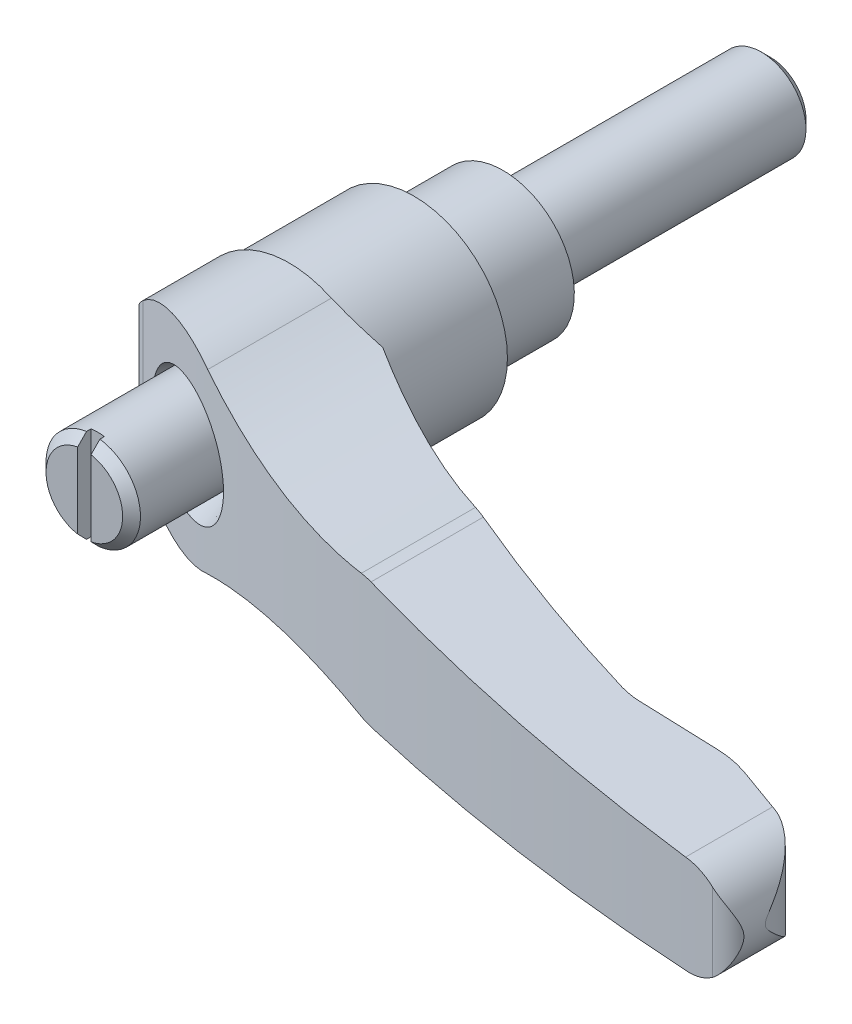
ISO-10303-21;
HEADER;
FILE_DESCRIPTION(('STEP AP214'),'2;1');
FILE_NAME('part.step','',(''),(''),'','','');
FILE_SCHEMA(('AUTOMOTIVE_DESIGN { 1 0 10303 214 1 1 1 1 }'));
ENDSEC;
DATA;
#1=APPLICATION_CONTEXT('core data for automotive mechanical design processes');
#2=APPLICATION_PROTOCOL_DEFINITION('international standard','automotive_design',2000,#1);
#3=PRODUCT_CONTEXT('',#1,'mechanical');
#4=PRODUCT('Part','Part','',(#3));
#5=PRODUCT_RELATED_PRODUCT_CATEGORY('part','',(#4));
#6=PRODUCT_DEFINITION_FORMATION('','',#4);
#7=PRODUCT_DEFINITION_CONTEXT('part definition',#1,'design');
#8=PRODUCT_DEFINITION('design','',#6,#7);
#9=PRODUCT_DEFINITION_SHAPE('','',#8);
#10=(LENGTH_UNIT() NAMED_UNIT(*) SI_UNIT(.MILLI.,.METRE.));
#11=(NAMED_UNIT(*) PLANE_ANGLE_UNIT() SI_UNIT($,.RADIAN.));
#12=(NAMED_UNIT(*) SI_UNIT($,.STERADIAN.) SOLID_ANGLE_UNIT());
#13=UNCERTAINTY_MEASURE_WITH_UNIT(LENGTH_MEASURE(1.E-05),#10,'distance_accuracy_value','');
#14=(GEOMETRIC_REPRESENTATION_CONTEXT(3) GLOBAL_UNCERTAINTY_ASSIGNED_CONTEXT((#13)) GLOBAL_UNIT_ASSIGNED_CONTEXT((#10,
#11,#12)) REPRESENTATION_CONTEXT('',''));
#15=CARTESIAN_POINT('',(0.,0.,0.));
#16=DIRECTION('',(0.,0.,1.));
#17=DIRECTION('',(1.,0.,0.));
#18=AXIS2_PLACEMENT_3D('',#15,#16,#17);
#19=CARTESIAN_POINT('',(-0.010000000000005,0.,27.8125));
#20=DIRECTION('',(0.,0.,-1.));
#21=DIRECTION('',(1.,0.,0.));
#22=AXIS2_PLACEMENT_3D('',#19,#20,#21);
#23=CYLINDRICAL_SURFACE('',#22,10.5);
#24=CARTESIAN_POINT('',(-0.0100000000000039,0.,24.));
#25=DIRECTION('',(0.,0.,1.));
#26=DIRECTION('',(0.,-1.,0.));
#27=AXIS2_PLACEMENT_3D('',#24,#25,#26);
#28=CIRCLE('',#27,10.5);
#29=CARTESIAN_POINT('',(-10.51,0.,24.));
#30=VERTEX_POINT('',#29);
#31=CARTESIAN_POINT('',(10.49,0.,24.));
#32=VERTEX_POINT('',#31);
#33=EDGE_CURVE('E571',#30,#32,#28,.T.);
#34=ORIENTED_EDGE('',*,*,#33,.F.);
#35=EDGE_CURVE('E575',#32,#30,#28,.T.);
#36=ORIENTED_EDGE('',*,*,#35,.F.);
#37=EDGE_LOOP('',(#34,#36));
#38=FACE_BOUND('',#37,.T.);
#39=CARTESIAN_POINT('',(-0.00999999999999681,0.,-0.250037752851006));
#40=DIRECTION('',(0.707106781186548,0.,0.707106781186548));
#41=DIRECTION('',(0.707106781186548,0.,-0.707106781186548));
#42=AXIS2_PLACEMENT_3D('',#39,#40,#41);
#43=ELLIPSE('',#42,14.8492424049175,10.5);
#44=CARTESIAN_POINT('',(-10.260037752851,-2.27743848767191,10.));
#45=VERTEX_POINT('',#44);
#46=CARTESIAN_POINT('',(-10.260037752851,2.27743848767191,10.));
#47=VERTEX_POINT('',#46);
#48=EDGE_CURVE('E294',#45,#47,#43,.F.);
#49=ORIENTED_EDGE('',*,*,#48,.F.);
#50=CARTESIAN_POINT('',(-0.0099999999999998,0.,10.));
#51=DIRECTION('',(0.,0.,-1.));
#52=DIRECTION('',(1.,0.,0.));
#53=AXIS2_PLACEMENT_3D('',#50,#51,#52);
#54=CIRCLE('',#53,10.5);
#55=EDGE_CURVE('E176',#47,#45,#54,.T.);
#56=ORIENTED_EDGE('',*,*,#55,.F.);
#57=EDGE_LOOP('',(#49,#56));
#58=FACE_BOUND('',#57,.T.);
#59=ADVANCED_FACE('F14',(#38,#58),#23,.T.);
#60=CARTESIAN_POINT('',(57.3760512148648,-12.,33.4699999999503));
#61=DIRECTION('',(0.,1.,0.));
#62=DIRECTION('',(-1.,0.,0.));
#63=AXIS2_PLACEMENT_3D('',#60,#61,#62);
#64=CYLINDRICAL_SURFACE('',#63,8.59000000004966);
#65=CARTESIAN_POINT('',(57.3760512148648,6.11892873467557,33.4699999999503));
#66=DIRECTION('',(0.0361204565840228,0.999347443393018,0.));
#67=DIRECTION('',(-0.999347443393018,0.0361204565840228,0.));
#68=AXIS2_PLACEMENT_3D('',#65,#66,#67);
#69=ELLIPSE('',#68,8.59560912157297,8.59000000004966);
#70=CARTESIAN_POINT('',(57.37605121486,6.11892873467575,42.06));
#71=VERTEX_POINT('',#70);
#72=CARTESIAN_POINT('',(55.1138126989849,6.20069518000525,41.7567591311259));
#73=VERTEX_POINT('',#72);
#74=EDGE_CURVE('E1126',#71,#73,#69,.F.);
#75=ORIENTED_EDGE('',*,*,#74,.F.);
#76=DIRECTION('',(0.,1.,0.));
#77=VECTOR('',#76,1.);
#78=CARTESIAN_POINT('',(57.37605121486,-12.,42.06));
#79=LINE('',#78,#77);
#80=CARTESIAN_POINT('',(57.37605121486,-6.11892873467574,42.06));
#81=VERTEX_POINT('',#80);
#82=EDGE_CURVE('E598',#81,#71,#79,.T.);
#83=ORIENTED_EDGE('',*,*,#82,.F.);
#84=CARTESIAN_POINT('',(57.3760512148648,-6.11892873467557,33.4699999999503));
#85=DIRECTION('',(0.0361204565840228,-0.999347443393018,0.));
#86=DIRECTION('',(0.999347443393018,0.0361204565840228,0.));
#87=AXIS2_PLACEMENT_3D('',#84,#85,#86);
#88=ELLIPSE('',#87,8.59560912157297,8.59000000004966);
#89=CARTESIAN_POINT('',(55.1138126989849,-6.20069518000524,41.7567591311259));
#90=VERTEX_POINT('',#89);
#91=EDGE_CURVE('E1119',#90,#81,#88,.F.);
#92=ORIENTED_EDGE('',*,*,#91,.F.);
#93=DIRECTION('',(0.,1.,0.));
#94=VECTOR('',#93,1.);
#95=CARTESIAN_POINT('',(55.1138126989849,-12.,41.7567591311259));
#96=LINE('',#95,#94);
#97=EDGE_CURVE('E601',#90,#73,#96,.T.);
#98=ORIENTED_EDGE('',*,*,#97,.T.);
#99=EDGE_LOOP('',(#75,#83,#92,#98));
#100=FACE_BOUND('',#99,.T.);
#101=ADVANCED_FACE('F384',(#100),#64,.F.);
#102=CARTESIAN_POINT('',(57.37605121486,-12.,42.06));
#103=DIRECTION('',(0.,0.,1.));
#104=DIRECTION('',(0.,-1.,0.));
#105=AXIS2_PLACEMENT_3D('',#102,#103,#104);
#106=PLANE('',#105);
#107=DIRECTION('',(-0.999347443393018,0.0361204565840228,0.));
#108=VECTOR('',#107,1.);
#109=CARTESIAN_POINT('',(58.0300881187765,6.09528919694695,42.06));
#110=LINE('',#109,#108);
#111=CARTESIAN_POINT('',(66.163324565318,5.80132115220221,42.06));
#112=VERTEX_POINT('',#111);
#113=EDGE_CURVE('E1127',#112,#71,#110,.T.);
#114=ORIENTED_EDGE('',*,*,#113,.F.);
#115=DIRECTION('',(0.,1.,0.));
#116=VECTOR('',#115,1.);
#117=CARTESIAN_POINT('',(66.163324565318,-12.,42.06));
#118=LINE('',#117,#116);
#119=CARTESIAN_POINT('',(66.163324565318,-5.80132115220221,42.06));
#120=VERTEX_POINT('',#119);
#121=EDGE_CURVE('E595',#120,#112,#118,.T.);
#122=ORIENTED_EDGE('',*,*,#121,.F.);
#123=DIRECTION('',(0.999347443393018,0.0361204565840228,0.));
#124=VECTOR('',#123,1.);
#125=CARTESIAN_POINT('',(57.1637628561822,-6.12660169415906,42.06));
#126=LINE('',#125,#124);
#127=EDGE_CURVE('E1124',#81,#120,#126,.T.);
#128=ORIENTED_EDGE('',*,*,#127,.F.);
#129=ORIENTED_EDGE('',*,*,#82,.T.);
#130=EDGE_LOOP('',(#114,#122,#128,#129));
#131=FACE_BOUND('',#130,.T.);
#132=ADVANCED_FACE('F523',(#131),#106,.F.);
#133=CARTESIAN_POINT('',(66.1633245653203,-12.,53.3399999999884));
#134=DIRECTION('',(0.,1.,0.));
#135=DIRECTION('',(-1.,0.,0.));
#136=AXIS2_PLACEMENT_3D('',#133,#134,#135);
#137=CYLINDRICAL_SURFACE('',#136,11.2799999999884);
#138=CARTESIAN_POINT('',(66.1633245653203,5.80132115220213,53.3399999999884));
#139=DIRECTION('',(0.0361204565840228,0.999347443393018,0.));
#140=DIRECTION('',(-0.999347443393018,0.0361204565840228,0.));
#141=AXIS2_PLACEMENT_3D('',#138,#139,#140);
#142=ELLIPSE('',#141,11.2873656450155,11.2799999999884);
#143=CARTESIAN_POINT('',(69.761185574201,5.6712799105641,42.649172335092));
#144=VERTEX_POINT('',#143);
#145=EDGE_CURVE('E1128',#144,#112,#142,.T.);
#146=ORIENTED_EDGE('',*,*,#145,.F.);
#147=DIRECTION('',(0.,1.,0.));
#148=VECTOR('',#147,1.);
#149=CARTESIAN_POINT('',(69.761185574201,-12.,42.649172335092));
#150=LINE('',#149,#148);
#151=CARTESIAN_POINT('',(69.761185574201,-5.6712799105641,42.649172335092));
#152=VERTEX_POINT('',#151);
#153=EDGE_CURVE('E592',#152,#144,#150,.T.);
#154=ORIENTED_EDGE('',*,*,#153,.F.);
#155=CARTESIAN_POINT('',(66.1633245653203,-5.80132115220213,53.3399999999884));
#156=DIRECTION('',(0.0361204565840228,-0.999347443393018,0.));
#157=DIRECTION('',(0.999347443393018,0.0361204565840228,0.));
#158=AXIS2_PLACEMENT_3D('',#155,#156,#157);
#159=ELLIPSE('',#158,11.2873656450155,11.2799999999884);
#160=EDGE_CURVE('E1149',#120,#152,#159,.T.);
#161=ORIENTED_EDGE('',*,*,#160,.F.);
#162=ORIENTED_EDGE('',*,*,#121,.T.);
#163=EDGE_LOOP('',(#146,#154,#161,#162));
#164=FACE_BOUND('',#163,.T.);
#165=ADVANCED_FACE('F424',(#164),#137,.T.);
#166=CARTESIAN_POINT('',(111.590768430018,-12.,-165.122809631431));
#167=DIRECTION('',(0.,1.,0.));
#168=DIRECTION('',(-1.,0.,0.));
#169=AXIS2_PLACEMENT_3D('',#166,#167,#168);
#170=CYLINDRICAL_SURFACE('',#169,214.450000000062);
#171=CARTESIAN_POINT('',(30.179428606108,-6.9666323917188,33.2732494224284));
#172=CARTESIAN_POINT('',(30.4222007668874,-7.0028281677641,33.3728739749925));
#173=CARTESIAN_POINT('',(30.6665043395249,-7.02781937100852,33.472598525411));
#174=CARTESIAN_POINT('',(31.033921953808,-7.04840105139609,33.6217860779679));
#175=CARTESIAN_POINT('',(31.1565128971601,-7.05244559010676,33.6714318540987));
#176=CARTESIAN_POINT('',(31.4020580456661,-7.05489552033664,33.7706062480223));
#177=CARTESIAN_POINT('',(31.5250125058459,-7.05329063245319,33.820134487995));
#178=CARTESIAN_POINT('',(31.647932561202,-7.0488469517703,33.8695155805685));
#179=B_SPLINE_CURVE_WITH_KNOTS('',3,(#171,#172,#173,#174,#175,#176,#177,#178),.UNSPECIFIED.,.F.,
.F.,(4,2,2,4),(0.,0.794258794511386,1.19111760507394,1.58869889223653),.UNSPECIFIED.);
#180=CARTESIAN_POINT('',(30.179428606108,-6.9666323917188,33.2732494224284));
#181=VERTEX_POINT('',#180);
#182=CARTESIAN_POINT('',(31.647932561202,-7.0488469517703,33.8695155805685));
#183=VERTEX_POINT('',#182);
#184=EDGE_CURVE('E440',#181,#183,#179,.T.);
#185=ORIENTED_EDGE('',*,*,#184,.F.);
#186=CARTESIAN_POINT('',(10.49,-8.03465812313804,24.));
#187=CARTESIAN_POINT('',(11.2781269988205,-7.82806345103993,24.4213315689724));
#188=CARTESIAN_POINT('',(12.0728488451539,-7.64070973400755,24.8398212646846));
#189=CARTESIAN_POINT('',(13.6740672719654,-7.30530099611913,25.6700985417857));
#190=CARTESIAN_POINT('',(14.4805646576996,-7.15724867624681,26.0818856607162));
#191=CARTESIAN_POINT('',(16.0966341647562,-6.90241973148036,26.8940746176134));
#192=CARTESIAN_POINT('',(16.906116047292,-6.79528972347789,27.2945449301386));
#193=CARTESIAN_POINT('',(18.5335723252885,-6.62127786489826,28.0868684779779));
#194=CARTESIAN_POINT('',(19.3515465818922,-6.55439535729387,28.4787218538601));
#195=CARTESIAN_POINT('',(20.9944633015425,-6.46166065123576,29.2529521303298));
#196=CARTESIAN_POINT('',(21.8194069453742,-6.43581555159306,29.6353273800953));
#197=CARTESIAN_POINT('',(23.474294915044,-6.42593469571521,30.3896366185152));
#198=CARTESIAN_POINT('',(24.3042391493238,-6.44189817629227,30.7615707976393));
#199=CARTESIAN_POINT('',(25.974600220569,-6.51667337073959,31.497417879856));
#200=CARTESIAN_POINT('',(26.8150445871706,-6.57586454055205,31.8612301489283));
#201=CARTESIAN_POINT('',(28.4970001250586,-6.7381558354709,32.5766232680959));
#202=CARTESIAN_POINT('',(29.3385114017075,-6.84126069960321,32.9282027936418));
#203=CARTESIAN_POINT('',(30.179428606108,-6.96663239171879,33.2732494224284));
#204=B_SPLINE_CURVE_WITH_KNOTS('',3,(#186,#187,#188,#189,#190,#191,#192,#193,#194,#195,#196,
#197,#198,#199,#200,#201,#202,#203),.UNSPECIFIED.,.F.,.F.,(4,2,2,2,2,2,2,2,4),(0.,
2.7515590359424,5.50330712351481,8.23072437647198,10.9580971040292,13.6859415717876,
16.4137362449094,19.1657679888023,21.9180967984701),.UNSPECIFIED.);
#205=CARTESIAN_POINT('',(10.49,-8.03465812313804,24.));
#206=VERTEX_POINT('',#205);
#207=EDGE_CURVE('E431',#206,#181,#204,.T.);
#208=ORIENTED_EDGE('',*,*,#207,.F.);
#209=DIRECTION('',(0.,1.,0.));
#210=VECTOR('',#209,1.);
#211=CARTESIAN_POINT('',(10.49,-12.,24.));
#212=LINE('',#211,#210);
#213=EDGE_CURVE('E605',#206,#32,#212,.T.);
#214=ORIENTED_EDGE('',*,*,#213,.T.);
#215=CARTESIAN_POINT('',(10.49,8.03465812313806,24.));
#216=VERTEX_POINT('',#215);
#217=EDGE_CURVE('E604',#32,#216,#212,.T.);
#218=ORIENTED_EDGE('',*,*,#217,.T.);
#219=CARTESIAN_POINT('',(30.179428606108,6.9666323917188,33.2732494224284));
#220=CARTESIAN_POINT('',(29.3385114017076,6.84126069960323,32.9282027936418));
#221=CARTESIAN_POINT('',(28.4970001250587,6.73815583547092,32.5766232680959));
#222=CARTESIAN_POINT('',(26.8150445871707,6.57586454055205,31.8612301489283));
#223=CARTESIAN_POINT('',(25.974600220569,6.51667337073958,31.497417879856));
#224=CARTESIAN_POINT('',(24.3042391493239,6.44189817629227,30.7615707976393));
#225=CARTESIAN_POINT('',(23.4742949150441,6.42593469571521,30.3896366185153));
#226=CARTESIAN_POINT('',(21.8194069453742,6.43581555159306,29.6353273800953));
#227=CARTESIAN_POINT('',(20.9944633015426,6.46166065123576,29.2529521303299));
#228=CARTESIAN_POINT('',(19.3515465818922,6.55439535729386,28.4787218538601));
#229=CARTESIAN_POINT('',(18.5335723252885,6.62127786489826,28.0868684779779));
#230=CARTESIAN_POINT('',(16.906116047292,6.79528972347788,27.2945449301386));
#231=CARTESIAN_POINT('',(16.0966341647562,6.90241973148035,26.8940746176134));
#232=CARTESIAN_POINT('',(14.4805646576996,7.15724867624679,26.0818856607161));
#233=CARTESIAN_POINT('',(13.6740672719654,7.30530099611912,25.6700985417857));
#234=CARTESIAN_POINT('',(12.0728488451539,7.64070973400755,24.8398212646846));
#235=CARTESIAN_POINT('',(11.2781269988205,7.82806345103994,24.4213315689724));
#236=CARTESIAN_POINT('',(10.49,8.03465812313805,24.));
#237=B_SPLINE_CURVE_WITH_KNOTS('',3,(#219,#220,#221,#222,#223,#224,#225,#226,#227,#228,#229,
#230,#231,#232,#233,#234,#235,#236),.UNSPECIFIED.,.F.,.F.,(4,2,2,2,2,2,2,2,4),(0.,
2.75232880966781,5.50436055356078,8.23215522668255,10.9599996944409,13.6873724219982,
16.4147896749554,19.1665377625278,21.9180967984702),.UNSPECIFIED.);
#238=CARTESIAN_POINT('',(30.179428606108,6.9666323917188,33.2732494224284));
#239=VERTEX_POINT('',#238);
#240=EDGE_CURVE('E411',#239,#216,#237,.T.);
#241=ORIENTED_EDGE('',*,*,#240,.F.);
#242=CARTESIAN_POINT('',(31.647932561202,7.0488469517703,33.8695155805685));
#243=CARTESIAN_POINT('',(31.5250125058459,7.05329063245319,33.820134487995));
#244=CARTESIAN_POINT('',(31.4020580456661,7.05489552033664,33.7706062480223));
#245=CARTESIAN_POINT('',(31.1565128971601,7.05244559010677,33.6714318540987));
#246=CARTESIAN_POINT('',(31.033921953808,7.04840105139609,33.6217860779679));
#247=CARTESIAN_POINT('',(30.666504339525,7.02781937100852,33.472598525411));
#248=CARTESIAN_POINT('',(30.4222007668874,7.0028281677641,33.3728739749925));
#249=CARTESIAN_POINT('',(30.179428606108,6.9666323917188,33.2732494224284));
#250=B_SPLINE_CURVE_WITH_KNOTS('',3,(#242,#243,#244,#245,#246,#247,#248,#249),.UNSPECIFIED.,.F.,
.F.,(4,2,2,4),(0.,0.39758128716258,0.794440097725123,1.58869889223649),.UNSPECIFIED.);
#251=CARTESIAN_POINT('',(31.647932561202,7.0488469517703,33.8695155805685));
#252=VERTEX_POINT('',#251);
#253=EDGE_CURVE('E403',#252,#239,#250,.T.);
#254=ORIENTED_EDGE('',*,*,#253,.F.);
#255=CARTESIAN_POINT('',(111.590768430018,4.15938968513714,-165.122809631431));
#256=DIRECTION('',(0.0361204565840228,0.999347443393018,0.));
#257=DIRECTION('',(-0.999347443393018,0.0361204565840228,0.));
#258=AXIS2_PLACEMENT_3D('',#255,#256,#257);
#259=ELLIPSE('',#258,214.590032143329,214.450000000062);
#260=EDGE_CURVE('E412',#73,#252,#259,.F.);
#261=ORIENTED_EDGE('',*,*,#260,.F.);
#262=ORIENTED_EDGE('',*,*,#97,.F.);
#263=CARTESIAN_POINT('',(111.590768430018,-4.15938968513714,-165.122809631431));
#264=DIRECTION('',(0.0361204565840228,-0.999347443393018,0.));
#265=DIRECTION('',(0.999347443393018,0.0361204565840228,0.));
#266=AXIS2_PLACEMENT_3D('',#263,#264,#265);
#267=ELLIPSE('',#266,214.590032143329,214.450000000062);
#268=EDGE_CURVE('E1117',#183,#90,#267,.F.);
#269=ORIENTED_EDGE('',*,*,#268,.F.);
#270=EDGE_LOOP('',(#185,#208,#214,#218,#241,#254,#261,#262,#269));
#271=FACE_BOUND('',#270,.T.);
#272=ADVANCED_FACE('F419',(#271),#170,.F.);
#273=CARTESIAN_POINT('',(79.996705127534,-12.,50.539592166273));
#274=DIRECTION('',(-0.99233193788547,0.,0.123601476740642));
#275=DIRECTION('',(-0.123601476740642,0.,-0.99233193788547));
#276=AXIS2_PLACEMENT_3D('',#273,#274,#275);
#277=PLANE('',#276);
#278=CARTESIAN_POINT('',(74.5,0.,6.40940703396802));
#279=DIRECTION('',(-0.99233193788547,0.,0.123601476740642));
#280=DIRECTION('',(0.123601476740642,0.,0.99233193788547));
#281=AXIS2_PLACEMENT_3D('',#278,#279,#280);
#282=ELLIPSE('',#281,44.4978502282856,5.5);
#283=CARTESIAN_POINT('',(79.996705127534,-0.190348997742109,50.539592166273));
#284=VERTEX_POINT('',#283);
#285=CARTESIAN_POINT('',(79.996705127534,0.190348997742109,50.539592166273));
#286=VERTEX_POINT('',#285);
#287=EDGE_CURVE('E505',#284,#286,#282,.T.);
#288=ORIENTED_EDGE('',*,*,#287,.F.);
#289=DIRECTION('',(0.,1.,0.));
#290=VECTOR('',#289,1.);
#291=CARTESIAN_POINT('',(79.996705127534,-12.,50.539592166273));
#292=LINE('',#291,#290);
#293=EDGE_CURVE('E586',#284,#286,#292,.T.);
#294=ORIENTED_EDGE('',*,*,#293,.T.);
#295=EDGE_LOOP('',(#288,#294));
#296=FACE_BOUND('',#295,.T.);
#297=ADVANCED_FACE('F423',(#296),#277,.F.);
#298=CARTESIAN_POINT('',(72.6137555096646,-12.,51.4591871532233));
#299=DIRECTION('',(0.,1.,0.));
#300=DIRECTION('',(-1.,0.,0.));
#301=AXIS2_PLACEMENT_3D('',#298,#299,#300);
#302=CYLINDRICAL_SURFACE('',#301,7.44000000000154);
#303=CARTESIAN_POINT('',(74.986812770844,-5.47841339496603,44.407790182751));
#304=CARTESIAN_POINT('',(75.1398120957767,-5.4648402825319,44.4592429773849));
#305=CARTESIAN_POINT('',(75.2905169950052,-5.44496899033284,44.5155387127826));
#306=CARTESIAN_POINT('',(75.5860882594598,-5.39377415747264,44.6368581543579));
#307=CARTESIAN_POINT('',(75.730963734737,-5.36246932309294,44.7018674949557));
#308=CARTESIAN_POINT('',(76.0125967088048,-5.2898955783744,44.839081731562));
#309=CARTESIAN_POINT('',(76.149425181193,-5.248738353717,44.9112009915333));
#310=CARTESIAN_POINT('',(76.4161065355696,-5.1573648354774,45.062373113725));
#311=CARTESIAN_POINT('',(76.5459558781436,-5.10714400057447,45.1414294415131));
#312=CARTESIAN_POINT('',(76.827653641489,-4.98604991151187,45.3247681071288));
#313=CARTESIAN_POINT('',(76.9775772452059,-4.91309116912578,45.4306358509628));
#314=CARTESIAN_POINT('',(77.2657899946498,-4.75681575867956,45.6501400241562));
#315=CARTESIAN_POINT('',(77.4040776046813,-4.67349772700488,45.7637774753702));
#316=CARTESIAN_POINT('',(77.8028296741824,-4.40945601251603,46.1156758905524));
#317=CARTESIAN_POINT('',(78.0457801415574,-4.21527563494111,46.3639882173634));
#318=CARTESIAN_POINT('',(78.4176945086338,-3.86589184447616,46.7984433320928));
#319=CARTESIAN_POINT('',(78.558647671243,-3.71726415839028,46.9799982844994));
#320=CARTESIAN_POINT('',(78.8199419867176,-3.41009407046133,47.3496806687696));
#321=CARTESIAN_POINT('',(78.9402736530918,-3.25154715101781,47.5378110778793));
#322=CARTESIAN_POINT('',(79.1607378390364,-2.92676895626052,47.9181651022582));
#323=CARTESIAN_POINT('',(79.2609186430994,-2.76055725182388,48.1103776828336));
#324=CARTESIAN_POINT('',(79.4421677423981,-2.42115236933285,48.497428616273));
#325=CARTESIAN_POINT('',(79.5232445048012,-2.24796232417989,48.6922657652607));
#326=CARTESIAN_POINT('',(79.657896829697,-1.91676087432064,49.0578102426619));
#327=CARTESIAN_POINT('',(79.713648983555,-1.75958096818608,49.2284695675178));
#328=CARTESIAN_POINT('',(79.7869638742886,-1.51825146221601,49.4826945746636));
#329=CARTESIAN_POINT('',(79.8097141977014,-1.43673320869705,49.5672896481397));
#330=CARTESIAN_POINT('',(79.8517302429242,-1.27132927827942,49.7350141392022));
#331=CARTESIAN_POINT('',(79.8709966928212,-1.18744410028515,49.8181438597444));
#332=CARTESIAN_POINT('',(79.907186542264,-1.01046435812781,49.986973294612));
#333=CARTESIAN_POINT('',(79.9238666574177,-0.917129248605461,50.0724723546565));
#334=CARTESIAN_POINT('',(79.9529450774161,-0.724505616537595,50.2358460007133));
#335=CARTESIAN_POINT('',(79.9653823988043,-0.625281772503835,50.3137850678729));
#336=CARTESIAN_POINT('',(79.9802376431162,-0.46858024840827,50.4153149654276));
#337=CARTESIAN_POINT('',(79.9845030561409,-0.416215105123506,50.4460963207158));
#338=CARTESIAN_POINT('',(79.9917045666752,-0.306879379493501,50.4998809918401));
#339=CARTESIAN_POINT('',(79.9946243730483,-0.249861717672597,50.522788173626));
#340=CARTESIAN_POINT('',(79.996705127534,-0.190348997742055,50.539592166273));
#341=B_SPLINE_CURVE_WITH_KNOTS('',3,(#303,#304,#305,#306,#307,#308,#309,#310,#311,#312,#313,
#314,#315,#316,#317,#318,#319,#320,#321,#322,#323,#324,#325,#326,#327,#328,#329,#330,#331,#332,
#333,#334,#335,#336,#337,#338,#339,#340),.UNSPECIFIED.,.F.,.F.,(4,2,2,2,2,2,2,2,2,2,2,2,2,2,2,2,
2,2,4),(0.,0.485611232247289,0.970431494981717,1.44999646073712,1.92980238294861,
2.52141817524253,3.11311192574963,4.30183389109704,5.12208341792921,5.94270927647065,
6.76134473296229,7.57961667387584,8.29494630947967,8.65387747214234,9.01273353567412,
9.39561932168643,9.77488268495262,9.95698827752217,10.1412441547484),.UNSPECIFIED.);
#342=CARTESIAN_POINT('',(74.986812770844,-5.47841339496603,44.407790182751));
#343=VERTEX_POINT('',#342);
#344=EDGE_CURVE('E504',#343,#284,#341,.T.);
#345=ORIENTED_EDGE('',*,*,#344,.F.);
#346=DIRECTION('',(0.,1.,0.));
#347=VECTOR('',#346,1.);
#348=CARTESIAN_POINT('',(74.986812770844,-12.,44.407790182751));
#349=LINE('',#348,#347);
#350=CARTESIAN_POINT('',(74.986812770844,5.47841339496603,44.407790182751));
#351=VERTEX_POINT('',#350);
#352=EDGE_CURVE('E589',#343,#351,#349,.T.);
#353=ORIENTED_EDGE('',*,*,#352,.T.);
#354=CARTESIAN_POINT('',(79.996705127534,0.190348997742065,50.539592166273));
#355=CARTESIAN_POINT('',(79.9951469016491,0.235214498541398,50.5270575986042));
#356=CARTESIAN_POINT('',(79.9930953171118,0.278736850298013,50.5108629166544));
#357=CARTESIAN_POINT('',(79.9881648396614,0.363077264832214,50.47327081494));
#358=CARTESIAN_POINT('',(79.9852922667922,0.403913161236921,50.451913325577));
#359=CARTESIAN_POINT('',(79.9757020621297,0.522458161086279,50.3833482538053));
#360=CARTESIAN_POINT('',(79.9679715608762,0.597169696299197,50.3312876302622));
#361=CARTESIAN_POINT('',(79.950886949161,0.736456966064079,50.225155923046));
#362=CARTESIAN_POINT('',(79.9416856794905,0.801375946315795,50.1714851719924));
#363=CARTESIAN_POINT('',(79.9214540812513,0.928420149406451,50.0612288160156));
#364=CARTESIAN_POINT('',(79.9104232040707,0.990544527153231,50.0046423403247));
#365=CARTESIAN_POINT('',(79.8746515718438,1.17419942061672,49.832312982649));
#366=CARTESIAN_POINT('',(79.847248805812,1.29287988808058,49.7141099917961));
#367=CARTESIAN_POINT('',(79.7848398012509,1.52823594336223,49.4729704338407));
#368=CARTESIAN_POINT('',(79.749692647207,1.64482416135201,49.3499864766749));
#369=CARTESIAN_POINT('',(79.6721004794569,1.8745831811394,49.1033284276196));
#370=CARTESIAN_POINT('',(79.6296610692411,1.98775652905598,48.9796549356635));
#371=CARTESIAN_POINT('',(79.5033816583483,2.29352791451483,48.641550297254));
#372=CARTESIAN_POINT('',(79.4120558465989,2.48329449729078,48.4272966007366));
#373=CARTESIAN_POINT('',(79.2061355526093,2.85434488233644,48.0023120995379));
#374=CARTESIAN_POINT('',(79.0915236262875,3.03562219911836,47.791584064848));
#375=CARTESIAN_POINT('',(78.8390032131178,3.38665877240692,47.3777391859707));
#376=CARTESIAN_POINT('',(78.7012752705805,3.5564939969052,47.174577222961));
#377=CARTESIAN_POINT('',(78.4009143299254,3.88356808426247,46.7768350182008));
#378=CARTESIAN_POINT('',(78.2383021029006,4.04081728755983,46.5822477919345));
#379=CARTESIAN_POINT('',(77.9568022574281,4.28016983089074,46.2794503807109));
#380=CARTESIAN_POINT('',(77.8461272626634,4.36735584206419,46.1675710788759));
#381=CARTESIAN_POINT('',(77.615129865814,4.53501217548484,45.9487274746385));
#382=CARTESIAN_POINT('',(77.4948054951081,4.61548112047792,45.8417641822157));
#383=CARTESIAN_POINT('',(77.2447591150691,4.76840923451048,45.633916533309));
#384=CARTESIAN_POINT('',(77.1150589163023,4.84088606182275,45.5330190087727));
#385=CARTESIAN_POINT('',(76.846172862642,4.97676025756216,45.3380932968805));
#386=CARTESIAN_POINT('',(76.7069926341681,5.04016294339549,45.2440611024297));
#387=CARTESIAN_POINT('',(76.4438690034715,5.14664435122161,45.079244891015));
#388=CARTESIAN_POINT('',(76.3213555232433,5.19134589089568,45.0072256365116));
#389=CARTESIAN_POINT('',(76.0703754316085,5.27269544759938,44.8693561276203));
#390=CARTESIAN_POINT('',(75.9419112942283,5.30934677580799,44.803503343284));
#391=CARTESIAN_POINT('',(75.6784961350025,5.3739797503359,44.6781572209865));
#392=CARTESIAN_POINT('',(75.5435027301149,5.40189236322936,44.618716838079));
#393=CARTESIAN_POINT('',(75.268600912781,5.44782102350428,44.5073869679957));
#394=CARTESIAN_POINT('',(75.1286862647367,5.46582399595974,44.4555075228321));
#395=CARTESIAN_POINT('',(74.986812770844,5.47841339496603,44.407790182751));
#396=B_SPLINE_CURVE_WITH_KNOTS('',3,(#354,#355,#356,#357,#358,#359,#360,#361,#362,#363,#364,
#365,#366,#367,#368,#369,#370,#371,#372,#373,#374,#375,#376,#377,#378,#379,#380,#381,#382,#383,
#384,#385,#386,#387,#388,#389,#390,#391,#392,#393,#394,#395),.UNSPECIFIED.,.F.,.F.,(4,2,2,2,2,2,
2,2,2,2,2,2,2,2,2,2,2,2,2,2,4),(0.,0.139245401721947,0.277446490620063,0.550810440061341,
0.804906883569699,1.05907965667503,1.56794086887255,2.08696422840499,2.60559053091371,
3.50582150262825,4.4067293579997,5.30090298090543,6.19433426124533,6.73367946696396,
7.27313498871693,7.81137365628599,8.34929561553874,8.7958064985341,9.24213337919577,
9.69190199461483,10.1422626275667),.UNSPECIFIED.);
#397=EDGE_CURVE('E498',#286,#351,#396,.T.);
#398=ORIENTED_EDGE('',*,*,#397,.F.);
#399=ORIENTED_EDGE('',*,*,#293,.F.);
#400=EDGE_LOOP('',(#345,#353,#398,#399));
#401=FACE_BOUND('',#400,.T.);
#402=ADVANCED_FACE('F511',(#401),#302,.T.);
#403=CARTESIAN_POINT('',(69.761185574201,-12.,42.649172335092));
#404=DIRECTION('',(-0.318959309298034,0.,0.947768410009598));
#405=DIRECTION('',(-0.947768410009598,0.,-0.318959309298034));
#406=AXIS2_PLACEMENT_3D('',#403,#404,#405);
#407=PLANE('',#406);
#408=DIRECTION('',(-0.947212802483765,0.0342360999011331,-0.318772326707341));
#409=VECTOR('',#408,1.);
#410=CARTESIAN_POINT('',(70.3342452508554,5.65056721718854,42.8420282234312));
#411=LINE('',#410,#409);
#412=CARTESIAN_POINT('',(74.5,5.5,44.2439595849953));
#413=VERTEX_POINT('',#412);
#414=EDGE_CURVE('E1132',#413,#144,#411,.T.);
#415=ORIENTED_EDGE('',*,*,#414,.F.);
#416=CARTESIAN_POINT('',(74.5,0.,44.2439595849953));
#417=DIRECTION('',(-0.318959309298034,0.,0.947768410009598));
#418=DIRECTION('',(0.947768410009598,0.,0.318959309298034));
#419=AXIS2_PLACEMENT_3D('',#416,#417,#418);
#420=ELLIPSE('',#419,5.80310542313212,5.5);
#421=EDGE_CURVE('E1133',#351,#413,#420,.T.);
#422=ORIENTED_EDGE('',*,*,#421,.F.);
#423=ORIENTED_EDGE('',*,*,#352,.F.);
#424=CARTESIAN_POINT('',(74.5,-5.5,44.2439595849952));
#425=VERTEX_POINT('',#424);
#426=EDGE_CURVE('E1134',#425,#343,#420,.T.);
#427=ORIENTED_EDGE('',*,*,#426,.F.);
#428=DIRECTION('',(0.947212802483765,0.0342360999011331,0.318772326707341));
#429=VECTOR('',#428,1.);
#430=CARTESIAN_POINT('',(69.5559523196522,-5.6786978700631,42.5801037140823));
#431=LINE('',#430,#429);
#432=EDGE_CURVE('E446',#152,#425,#431,.T.);
#433=ORIENTED_EDGE('',*,*,#432,.F.);
#434=ORIENTED_EDGE('',*,*,#153,.T.);
#435=EDGE_LOOP('',(#415,#422,#423,#427,#433,#434));
#436=FACE_BOUND('',#435,.T.);
#437=ADVANCED_FACE('F516',(#436),#407,.F.);
#438=CARTESIAN_POINT('',(-10.51,-12.,24.));
#439=DIRECTION('',(0.,0.,1.));
#440=DIRECTION('',(0.,-1.,0.));
#441=AXIS2_PLACEMENT_3D('',#438,#439,#440);
#442=PLANE('',#441);
#443=CARTESIAN_POINT('',(22.94,55.5300000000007,24.));
#444=DIRECTION('',(0.,0.,1.));
#445=DIRECTION('',(0.,-1.,0.));
#446=AXIS2_PLACEMENT_3D('',#443,#444,#445);
#447=CIRCLE('',#446,49.1000000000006);
#448=CARTESIAN_POINT('',(4.7225102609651,9.9346815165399,24.));
#449=VERTEX_POINT('',#448);
#450=EDGE_CURVE('E572',#216,#449,#447,.F.);
#451=ORIENTED_EDGE('',*,*,#450,.F.);
#452=ORIENTED_EDGE('',*,*,#217,.F.);
#453=ORIENTED_EDGE('',*,*,#35,.T.);
#454=DIRECTION('',(0.,1.,0.));
#455=VECTOR('',#454,1.);
#456=CARTESIAN_POINT('',(-10.51,-12.,24.));
#457=LINE('',#456,#455);
#458=CARTESIAN_POINT('',(-10.51,3.24652121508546,24.));
#459=VERTEX_POINT('',#458);
#460=EDGE_CURVE('E606',#30,#459,#457,.T.);
#461=ORIENTED_EDGE('',*,*,#460,.T.);
#462=CARTESIAN_POINT('',(0.,0.,24.));
#463=DIRECTION('',(0.,0.,1.));
#464=DIRECTION('',(0.,-1.,0.));
#465=AXIS2_PLACEMENT_3D('',#462,#463,#464);
#466=CIRCLE('',#465,11.);
#467=EDGE_CURVE('E618',#449,#459,#466,.T.);
#468=ORIENTED_EDGE('',*,*,#467,.F.);
#469=EDGE_LOOP('',(#451,#452,#453,#461,#468));
#470=FACE_BOUND('',#469,.T.);
#471=ADVANCED_FACE('F427',(#470),#442,.F.);
#472=CARTESIAN_POINT('',(22.94,-55.5300000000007,24.));
#473=DIRECTION('',(0.,0.,1.));
#474=DIRECTION('',(0.,-1.,0.));
#475=AXIS2_PLACEMENT_3D('',#472,#473,#474);
#476=CIRCLE('',#475,49.1000000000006);
#477=CARTESIAN_POINT('',(4.7225102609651,-9.9346815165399,24.));
#478=VERTEX_POINT('',#477);
#479=EDGE_CURVE('E447',#478,#206,#476,.F.);
#480=ORIENTED_EDGE('',*,*,#479,.F.);
#481=CARTESIAN_POINT('',(0.,0.,24.));
#482=DIRECTION('',(0.,0.,1.));
#483=DIRECTION('',(0.,-1.,0.));
#484=AXIS2_PLACEMENT_3D('',#481,#482,#483);
#485=CIRCLE('',#484,11.);
#486=CARTESIAN_POINT('',(-10.51,-3.24652121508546,24.));
#487=VERTEX_POINT('',#486);
#488=EDGE_CURVE('E632',#487,#478,#485,.T.);
#489=ORIENTED_EDGE('',*,*,#488,.F.);
#490=EDGE_CURVE('E607',#487,#30,#457,.T.);
#491=ORIENTED_EDGE('',*,*,#490,.T.);
#492=ORIENTED_EDGE('',*,*,#33,.T.);
#493=ORIENTED_EDGE('',*,*,#213,.F.);
#494=EDGE_LOOP('',(#480,#489,#491,#492,#493));
#495=FACE_BOUND('',#494,.T.);
#496=ADVANCED_FACE('F642',(#495),#442,.F.);
#497=CARTESIAN_POINT('',(77.9746679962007,-12.,52.1048483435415));
#498=DIRECTION('',(0.,1.,0.));
#499=DIRECTION('',(-1.,0.,0.));
#500=AXIS2_PLACEMENT_3D('',#497,#498,#499);
#501=CYLINDRICAL_SURFACE('',#500,2.20000000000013);
#502=CARTESIAN_POINT('',(77.798742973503,4.40094248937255,54.297803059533));
#503=CARTESIAN_POINT('',(77.873929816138,4.34461033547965,54.3038288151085));
#504=CARTESIAN_POINT('',(77.9477917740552,4.28621521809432,54.3058709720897));
#505=CARTESIAN_POINT('',(78.0922208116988,4.16589830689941,54.3028912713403));
#506=CARTESIAN_POINT('',(78.1627937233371,4.10398322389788,54.2978824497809));
#507=CARTESIAN_POINT('',(78.2996338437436,3.97761161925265,54.2817956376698));
#508=CARTESIAN_POINT('',(78.3659353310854,3.91318450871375,54.2707752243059));
#509=CARTESIAN_POINT('',(78.4947211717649,3.78162408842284,54.2435114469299));
#510=CARTESIAN_POINT('',(78.5572032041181,3.71448917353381,54.2272649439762));
#511=CARTESIAN_POINT('',(78.7037263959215,3.54901721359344,54.182483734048));
#512=CARTESIAN_POINT('',(78.7857223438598,3.44948168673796,54.1516573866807));
#513=CARTESIAN_POINT('',(78.9414411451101,3.24653335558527,54.0828783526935));
#514=CARTESIAN_POINT('',(79.0151615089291,3.14311939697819,54.0449235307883));
#515=CARTESIAN_POINT('',(79.2246832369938,2.82692774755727,53.9224540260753));
#516=CARTESIAN_POINT('',(79.3481089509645,2.609042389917,53.829588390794));
#517=CARTESIAN_POINT('',(79.5118173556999,2.26904106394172,53.6805956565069));
#518=CARTESIAN_POINT('',(79.5637254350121,2.15065893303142,53.6280001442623));
#519=CARTESIAN_POINT('',(79.6590195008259,1.91080459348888,53.5218995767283));
#520=CARTESIAN_POINT('',(79.7024022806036,1.789331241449,53.4683941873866));
#521=CARTESIAN_POINT('',(79.7806945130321,1.54303752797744,53.3628544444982));
#522=CARTESIAN_POINT('',(79.8156035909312,1.41821701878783,53.3108201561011));
#523=CARTESIAN_POINT('',(79.8768533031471,1.16468164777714,53.2116769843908));
#524=CARTESIAN_POINT('',(79.9031999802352,1.03596960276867,53.1645646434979));
#525=CARTESIAN_POINT('',(79.9502292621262,0.753846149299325,53.0744438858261));
#526=CARTESIAN_POINT('',(79.9694918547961,0.599603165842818,53.0330810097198));
#527=CARTESIAN_POINT('',(79.9884623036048,0.364537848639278,52.9907827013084));
#528=CARTESIAN_POINT('',(79.993132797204,0.285927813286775,52.9799792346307));
#529=CARTESIAN_POINT('',(79.9990802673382,0.12789817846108,52.9661347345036));
#530=CARTESIAN_POINT('',(80.0003586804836,0.048478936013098,52.9630904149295));
#531=CARTESIAN_POINT('',(79.9994656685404,-0.110643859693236,52.965194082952));
#532=CARTESIAN_POINT('',(79.9972760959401,-0.190346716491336,52.9703851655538));
#533=CARTESIAN_POINT('',(79.9895067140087,-0.348729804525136,52.9883178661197));
#534=CARTESIAN_POINT('',(79.983925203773,-0.427409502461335,53.0010632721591));
#535=CARTESIAN_POINT('',(79.9622241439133,-0.662630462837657,53.0486779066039));
#536=CARTESIAN_POINT('',(79.9411622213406,-0.816788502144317,53.0928557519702));
#537=CARTESIAN_POINT('',(79.8883952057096,-1.11212828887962,53.1914221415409));
#538=CARTESIAN_POINT('',(79.85716938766,-1.25358307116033,53.245309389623));
#539=CARTESIAN_POINT('',(79.7842829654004,-1.53200335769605,53.3577691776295));
#540=CARTESIAN_POINT('',(79.74261300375,-1.66896471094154,53.4163458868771));
#541=CARTESIAN_POINT('',(79.6489027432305,-1.93886019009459,53.5340438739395));
#542=CARTESIAN_POINT('',(79.5968732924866,-2.07179836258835,53.5931645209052));
#543=CARTESIAN_POINT('',(79.4822877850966,-2.33393789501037,53.709135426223));
#544=CARTESIAN_POINT('',(79.4197377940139,-2.46314135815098,53.7659869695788));
#545=CARTESIAN_POINT('',(79.2437827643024,-2.7926663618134,53.9072079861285));
#546=CARTESIAN_POINT('',(79.1220745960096,-2.99022899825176,53.988148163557));
#547=CARTESIAN_POINT('',(78.9187262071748,-3.27696925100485,54.093454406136));
#548=CARTESIAN_POINT('',(78.8476226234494,-3.37079169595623,54.1258294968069));
#549=CARTESIAN_POINT('',(78.6984500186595,-3.55485935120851,54.1839198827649));
#550=CARTESIAN_POINT('',(78.6203863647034,-3.64510724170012,54.209640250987));
#551=CARTESIAN_POINT('',(78.4833241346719,-3.79339526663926,54.2460114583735));
#552=CARTESIAN_POINT('',(78.4261294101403,-3.85257392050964,54.2588546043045));
#553=CARTESIAN_POINT('',(78.3087404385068,-3.96866565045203,54.2801534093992));
#554=CARTESIAN_POINT('',(78.2485476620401,-4.02557981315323,54.2886111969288));
#555=CARTESIAN_POINT('',(78.1248892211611,-4.13728909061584,54.300599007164));
#556=CARTESIAN_POINT('',(78.06140209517,-4.19206473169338,54.3040909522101));
#557=CARTESIAN_POINT('',(77.9318740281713,-4.29875909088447,54.3053863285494));
#558=CARTESIAN_POINT('',(77.865829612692,-4.35067367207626,54.3031817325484));
#559=CARTESIAN_POINT('',(77.798742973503,-4.40094248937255,54.297803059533));
#560=B_SPLINE_CURVE_WITH_KNOTS('',3,(#502,#503,#504,#505,#506,#507,#508,#509,#510,#511,#512,
#513,#514,#515,#516,#517,#518,#519,#520,#521,#522,#523,#524,#525,#526,#527,#528,#529,#530,#531,
#532,#533,#534,#535,#536,#537,#538,#539,#540,#541,#542,#543,#544,#545,#546,#547,#548,#549,#550,
#551,#552,#553,#554,#555,#556,#557,#558,#559),.UNSPECIFIED.,.F.,.F.,(4,2,2,2,2,2,2,2,2,2,2,2,2,
2,2,2,2,2,2,2,2,2,2,2,2,2,2,2,4),(0.,0.282196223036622,0.563871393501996,0.84289495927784,
1.12208642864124,1.51924084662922,1.91651441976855,2.71446317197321,3.13292824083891,
3.55155041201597,3.97019109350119,4.38853568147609,4.86893910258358,5.10700790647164,
5.34497586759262,5.58419320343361,5.82353059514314,6.30682886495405,6.77001918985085,
7.23362600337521,7.69674987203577,8.15960763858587,8.89408077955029,9.26002910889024,
9.62569764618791,9.87541390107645,10.1250088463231,10.3765075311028,10.6283608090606),.UNSPECIFIED.);
#561=CARTESIAN_POINT('',(77.798742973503,4.40094248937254,54.297803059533));
#562=VERTEX_POINT('',#561);
#563=CARTESIAN_POINT('',(77.798742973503,-4.40094248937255,54.297803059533));
#564=VERTEX_POINT('',#563);
#565=EDGE_CURVE('E490',#562,#564,#560,.T.);
#566=ORIENTED_EDGE('',*,*,#565,.F.);
#567=DIRECTION('',(0.,1.,0.));
#568=VECTOR('',#567,1.);
#569=CARTESIAN_POINT('',(77.798742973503,-12.,54.297803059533));
#570=LINE('',#569,#568);
#571=EDGE_CURVE('E583',#564,#562,#570,.T.);
#572=ORIENTED_EDGE('',*,*,#571,.F.);
#573=EDGE_LOOP('',(#566,#572));
#574=FACE_BOUND('',#573,.T.);
#575=ADVANCED_FACE('F918',(#574),#501,.T.);
#576=CARTESIAN_POINT('',(31.647932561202,-7.0488469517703,0.));
#577=DIRECTION('',(0.0361204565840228,-0.999347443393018,0.));
#578=DIRECTION('',(0.999347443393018,0.0361204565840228,0.));
#579=AXIS2_PLACEMENT_3D('',#576,#577,#578);
#580=PLANE('',#579);
#581=ORIENTED_EDGE('',*,*,#268,.T.);
#582=ORIENTED_EDGE('',*,*,#91,.T.);
#583=ORIENTED_EDGE('',*,*,#127,.T.);
#584=ORIENTED_EDGE('',*,*,#160,.T.);
#585=ORIENTED_EDGE('',*,*,#432,.T.);
#586=DIRECTION('',(0.,0.,1.));
#587=VECTOR('',#586,1.);
#588=CARTESIAN_POINT('',(74.5,-5.5,0.));
#589=LINE('',#588,#587);
#590=CARTESIAN_POINT('',(74.5,-5.5,54.0125431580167));
#591=VERTEX_POINT('',#590);
#592=EDGE_CURVE('E308',#425,#591,#589,.T.);
#593=ORIENTED_EDGE('',*,*,#592,.T.);
#594=CARTESIAN_POINT('',(99.1192564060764,-4.61016054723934,-211.468372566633));
#595=DIRECTION('',(0.0361204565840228,-0.999347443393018,0.));
#596=DIRECTION('',(0.999347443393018,0.0361204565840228,0.));
#597=AXIS2_PLACEMENT_3D('',#594,#595,#596);
#598=ELLIPSE('',#597,266.794098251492,266.619999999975);
#599=CARTESIAN_POINT('',(31.647932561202,-7.0488469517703,46.4731806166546));
#600=VERTEX_POINT('',#599);
#601=EDGE_CURVE('E462',#591,#600,#598,.T.);
#602=ORIENTED_EDGE('',*,*,#601,.T.);
#603=DIRECTION('',(0.,0.,1.));
#604=VECTOR('',#603,1.);
#605=CARTESIAN_POINT('',(31.647932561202,-7.0488469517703,0.));
#606=LINE('',#605,#604);
#607=EDGE_CURVE('E305',#183,#600,#606,.T.);
#608=ORIENTED_EDGE('',*,*,#607,.F.);
#609=EDGE_LOOP('',(#581,#582,#583,#584,#585,#593,#602,#608));
#610=FACE_BOUND('',#609,.T.);
#611=ADVANCED_FACE('F453',(#610),#580,.T.);
#612=CARTESIAN_POINT('',(31.3589689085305,0.94593259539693,0.));
#613=DIRECTION('',(0.,0.,1.));
#614=DIRECTION('',(0.,-1.,0.));
#615=AXIS2_PLACEMENT_3D('',#612,#613,#614);
#616=CYLINDRICAL_SURFACE('',#615,8.00000000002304);
#617=ORIENTED_EDGE('',*,*,#184,.T.);
#618=ORIENTED_EDGE('',*,*,#607,.T.);
#619=CARTESIAN_POINT('',(31.647932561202,-7.0488469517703,46.4731806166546));
#620=CARTESIAN_POINT('',(31.4018180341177,-7.05768532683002,46.408799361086));
#621=CARTESIAN_POINT('',(31.1563854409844,-7.05525330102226,46.344225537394));
#622=CARTESIAN_POINT('',(30.6668841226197,-7.02784844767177,46.2146927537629));
#623=CARTESIAN_POINT('',(30.4228153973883,-7.00287562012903,46.1497337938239));
#624=CARTESIAN_POINT('',(30.179428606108,-6.9666323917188,46.0845822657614));
#625=B_SPLINE_CURVE_WITH_KNOTS('',3,(#619,#620,#621,#622,#623,#624),.UNSPECIFIED.,.F.,.F.,(4,2,
4),(0.,0.761390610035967,1.52278122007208),.UNSPECIFIED.);
#626=CARTESIAN_POINT('',(30.179428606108,-6.9666323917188,46.0845822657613));
#627=VERTEX_POINT('',#626);
#628=EDGE_CURVE('E456',#600,#627,#625,.T.);
#629=ORIENTED_EDGE('',*,*,#628,.T.);
#630=DIRECTION('',(0.,0.,1.));
#631=VECTOR('',#630,1.);
#632=CARTESIAN_POINT('',(30.179428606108,-6.9666323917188,0.));
#633=LINE('',#632,#631);
#634=EDGE_CURVE('E302',#181,#627,#633,.T.);
#635=ORIENTED_EDGE('',*,*,#634,.F.);
#636=EDGE_LOOP('',(#617,#618,#629,#635));
#637=FACE_BOUND('',#636,.T.);
#638=ADVANCED_FACE('F449',(#637),#616,.T.);
#639=CARTESIAN_POINT('',(22.94,-55.5300000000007,0.));
#640=DIRECTION('',(0.,0.,1.));
#641=DIRECTION('',(0.,-1.,0.));
#642=AXIS2_PLACEMENT_3D('',#639,#640,#641);
#643=CYLINDRICAL_SURFACE('',#642,49.1000000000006);
#644=ORIENTED_EDGE('',*,*,#479,.T.);
#645=ORIENTED_EDGE('',*,*,#207,.T.);
#646=ORIENTED_EDGE('',*,*,#634,.T.);
#647=CARTESIAN_POINT('',(30.179428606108,-6.96663239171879,46.0845822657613));
#648=CARTESIAN_POINT('',(29.4553482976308,-6.85868252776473,45.8907746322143));
#649=CARTESIAN_POINT('',(28.729831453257,-6.76709208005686,45.6932930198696));
#650=CARTESIAN_POINT('',(27.2773814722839,-6.61650566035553,45.291312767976));
#651=CARTESIAN_POINT('',(26.550448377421,-6.5575087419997,45.0868143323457));
#652=CARTESIAN_POINT('',(25.0965601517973,-6.471977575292,44.6711142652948));
#653=CARTESIAN_POINT('',(24.3696050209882,-6.44544423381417,44.4599124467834));
#654=CARTESIAN_POINT('',(22.9171454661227,-6.42463238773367,44.0312093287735));
#655=CARTESIAN_POINT('',(22.1916410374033,-6.43035377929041,43.8137080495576));
#656=CARTESIAN_POINT('',(20.0493707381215,-6.49464247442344,43.1615010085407));
#657=CARTESIAN_POINT('',(18.6362884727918,-6.59858948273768,42.718348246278));
#658=CARTESIAN_POINT('',(15.8309607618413,-6.92685704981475,41.8130049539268));
#659=CARTESIAN_POINT('',(14.4387083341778,-7.15113630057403,41.3508210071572));
#660=CARTESIAN_POINT('',(12.351397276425,-7.57984707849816,40.6389991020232));
#661=CARTESIAN_POINT('',(11.6453595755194,-7.74124938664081,40.3948734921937));
#662=CARTESIAN_POINT('',(10.2423533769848,-8.09475068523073,39.9032102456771));
#663=CARTESIAN_POINT('',(9.54538288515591,-8.28684279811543,39.6556733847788));
#664=CARTESIAN_POINT('',(8.15397624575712,-8.70354710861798,39.1550395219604));
#665=CARTESIAN_POINT('',(7.45965103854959,-8.9284917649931,38.9019113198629));
#666=CARTESIAN_POINT('',(6.0822924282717,-9.40885674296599,38.3933645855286));
#667=CARTESIAN_POINT('',(5.39926142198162,-9.66428344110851,38.1379455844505));
#668=CARTESIAN_POINT('',(4.72251026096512,-9.93468151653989,37.8817401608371));
#669=B_SPLINE_CURVE_WITH_KNOTS('',3,(#647,#648,#649,#650,#651,#652,#653,#654,#655,#656,#657,
#658,#659,#660,#661,#662,#663,#664,#665,#666,#667,#668),.UNSPECIFIED.,.F.,.F.,(4,2,2,2,2,2,2,2,
2,2,4),(0.,2.27169105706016,4.54331615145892,6.81500470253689,9.08668594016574,13.5348660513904,
17.9815201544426,20.2738137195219,22.5655943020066,24.8824210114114,27.1997332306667),.UNSPECIFIED.);
#670=CARTESIAN_POINT('',(4.7225102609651,-9.9346815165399,37.8817401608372));
#671=VERTEX_POINT('',#670);
#672=EDGE_CURVE('E365',#627,#671,#669,.T.);
#673=ORIENTED_EDGE('',*,*,#672,.T.);
#674=DIRECTION('',(0.,0.,1.));
#675=VECTOR('',#674,1.);
#676=CARTESIAN_POINT('',(4.7225102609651,-9.9346815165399,0.));
#677=LINE('',#676,#675);
#678=EDGE_CURVE('E299',#478,#671,#677,.T.);
#679=ORIENTED_EDGE('',*,*,#678,.F.);
#680=EDGE_LOOP('',(#644,#645,#646,#673,#679));
#681=FACE_BOUND('',#680,.T.);
#682=ADVANCED_FACE('F344',(#681),#643,.F.);
#683=CARTESIAN_POINT('',(22.94,55.5300000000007,0.));
#684=DIRECTION('',(0.,0.,1.));
#685=DIRECTION('',(0.,-1.,0.));
#686=AXIS2_PLACEMENT_3D('',#683,#684,#685);
#687=CYLINDRICAL_SURFACE('',#686,49.1000000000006);
#688=ORIENTED_EDGE('',*,*,#450,.T.);
#689=DIRECTION('',(0.,0.,1.));
#690=VECTOR('',#689,1.);
#691=CARTESIAN_POINT('',(4.7225102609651,9.9346815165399,0.));
#692=LINE('',#691,#690);
#693=CARTESIAN_POINT('',(4.7225102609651,9.9346815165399,37.8817401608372));
#694=VERTEX_POINT('',#693);
#695=EDGE_CURVE('E296',#449,#694,#692,.T.);
#696=ORIENTED_EDGE('',*,*,#695,.T.);
#697=CARTESIAN_POINT('',(4.72251026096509,9.93468151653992,37.8817401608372));
#698=CARTESIAN_POINT('',(5.38601967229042,9.6695845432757,38.132928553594));
#699=CARTESIAN_POINT('',(6.05547912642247,9.4188950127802,38.3833346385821));
#700=CARTESIAN_POINT('',(7.40543727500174,8.94675230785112,38.8820168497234));
#701=CARTESIAN_POINT('',(8.0859363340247,8.72530010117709,39.1302929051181));
#702=CARTESIAN_POINT('',(10.1431096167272,8.10531360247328,39.8712239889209));
#703=CARTESIAN_POINT('',(11.5349994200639,7.75133354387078,40.3598072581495));
#704=CARTESIAN_POINT('',(14.3196466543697,7.17216929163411,41.3109198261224));
#705=CARTESIAN_POINT('',(15.7117617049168,6.94441673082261,41.7737817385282));
#706=CARTESIAN_POINT('',(18.5161183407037,6.60933679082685,42.6802593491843));
#707=CARTESIAN_POINT('',(19.9283492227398,6.50194762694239,43.1238848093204));
#708=CARTESIAN_POINT('',(22.0758785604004,6.43216342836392,43.7788145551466));
#709=CARTESIAN_POINT('',(22.8074388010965,6.4247152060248,43.9984832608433));
#710=CARTESIAN_POINT('',(24.2719625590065,6.44260972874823,44.4313921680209));
#711=CARTESIAN_POINT('',(25.0049257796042,6.46794617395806,44.6446335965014));
#712=CARTESIAN_POINT('',(26.4790301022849,6.55208369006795,45.0666464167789));
#713=CARTESIAN_POINT('',(27.2201718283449,6.61125245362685,45.275342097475));
#714=CARTESIAN_POINT('',(28.7011833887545,6.7634815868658,45.6854942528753));
#715=CARTESIAN_POINT('',(29.441052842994,6.85655075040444,45.8869488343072));
#716=CARTESIAN_POINT('',(30.179428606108,6.9666323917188,46.0845822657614));
#717=B_SPLINE_CURVE_WITH_KNOTS('',3,(#697,#698,#699,#700,#701,#702,#703,#704,#705,#706,#707,
#708,#709,#710,#711,#712,#713,#714,#715,#716),.UNSPECIFIED.,.F.,.F.,(4,2,2,2,2,2,2,2,2,4),(0.,
2.27178178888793,4.54363875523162,9.08892529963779,13.5379720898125,17.9847340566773,
20.2757253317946,22.5662764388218,24.8822079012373,27.1987405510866),.UNSPECIFIED.);
#718=CARTESIAN_POINT('',(30.179428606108,6.9666323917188,46.0845822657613));
#719=VERTEX_POINT('',#718);
#720=EDGE_CURVE('E469',#694,#719,#717,.T.);
#721=ORIENTED_EDGE('',*,*,#720,.T.);
#722=DIRECTION('',(0.,0.,1.));
#723=VECTOR('',#722,1.);
#724=CARTESIAN_POINT('',(30.179428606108,6.9666323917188,0.));
#725=LINE('',#724,#723);
#726=EDGE_CURVE('E315',#239,#719,#725,.T.);
#727=ORIENTED_EDGE('',*,*,#726,.F.);
#728=ORIENTED_EDGE('',*,*,#240,.T.);
#729=EDGE_LOOP('',(#688,#696,#721,#727,#728));
#730=FACE_BOUND('',#729,.T.);
#731=ADVANCED_FACE('F341',(#730),#687,.F.);
#732=CARTESIAN_POINT('',(31.3589689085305,-0.945932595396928,0.));
#733=DIRECTION('',(0.,0.,1.));
#734=DIRECTION('',(0.,-1.,0.));
#735=AXIS2_PLACEMENT_3D('',#732,#733,#734);
#736=CYLINDRICAL_SURFACE('',#735,8.00000000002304);
#737=ORIENTED_EDGE('',*,*,#253,.T.);
#738=ORIENTED_EDGE('',*,*,#726,.T.);
#739=CARTESIAN_POINT('',(30.179428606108,6.9666323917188,46.0845822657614));
#740=CARTESIAN_POINT('',(30.4228153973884,7.00287562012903,46.1497337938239));
#741=CARTESIAN_POINT('',(30.6668841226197,7.02784844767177,46.214692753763));
#742=CARTESIAN_POINT('',(31.1563854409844,7.05525330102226,46.344225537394));
#743=CARTESIAN_POINT('',(31.4018180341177,7.05768532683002,46.408799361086));
#744=CARTESIAN_POINT('',(31.647932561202,7.0488469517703,46.4731806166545));
#745=B_SPLINE_CURVE_WITH_KNOTS('',3,(#739,#740,#741,#742,#743,#744),.UNSPECIFIED.,.F.,.F.,(4,2,
4),(0.,0.76139061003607,1.522781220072),.UNSPECIFIED.);
#746=CARTESIAN_POINT('',(31.647932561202,7.0488469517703,46.4731806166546));
#747=VERTEX_POINT('',#746);
#748=EDGE_CURVE('E395',#719,#747,#745,.T.);
#749=ORIENTED_EDGE('',*,*,#748,.T.);
#750=DIRECTION('',(0.,0.,1.));
#751=VECTOR('',#750,1.);
#752=CARTESIAN_POINT('',(31.647932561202,7.0488469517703,0.));
#753=LINE('',#752,#751);
#754=EDGE_CURVE('E314',#252,#747,#753,.T.);
#755=ORIENTED_EDGE('',*,*,#754,.F.);
#756=EDGE_LOOP('',(#737,#738,#749,#755));
#757=FACE_BOUND('',#756,.T.);
#758=ADVANCED_FACE('F386',(#757),#736,.T.);
#759=CARTESIAN_POINT('',(74.5,5.5,0.));
#760=DIRECTION('',(0.0361204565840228,0.999347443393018,0.));
#761=DIRECTION('',(-0.999347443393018,0.0361204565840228,0.));
#762=AXIS2_PLACEMENT_3D('',#759,#760,#761);
#763=PLANE('',#762);
#764=ORIENTED_EDGE('',*,*,#260,.T.);
#765=ORIENTED_EDGE('',*,*,#754,.T.);
#766=CARTESIAN_POINT('',(99.1192564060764,4.61016054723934,-211.468372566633));
#767=DIRECTION('',(0.0361204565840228,0.999347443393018,0.));
#768=DIRECTION('',(-0.999347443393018,0.0361204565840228,0.));
#769=AXIS2_PLACEMENT_3D('',#766,#767,#768);
#770=ELLIPSE('',#769,266.794098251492,266.619999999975);
#771=CARTESIAN_POINT('',(74.5,5.5,54.0125431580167));
#772=VERTEX_POINT('',#771);
#773=EDGE_CURVE('E655',#747,#772,#770,.T.);
#774=ORIENTED_EDGE('',*,*,#773,.T.);
#775=DIRECTION('',(0.,0.,1.));
#776=VECTOR('',#775,1.);
#777=CARTESIAN_POINT('',(74.5,5.5,0.));
#778=LINE('',#777,#776);
#779=EDGE_CURVE('E311',#413,#772,#778,.T.);
#780=ORIENTED_EDGE('',*,*,#779,.F.);
#781=ORIENTED_EDGE('',*,*,#414,.T.);
#782=ORIENTED_EDGE('',*,*,#145,.T.);
#783=ORIENTED_EDGE('',*,*,#113,.T.);
#784=ORIENTED_EDGE('',*,*,#74,.T.);
#785=EDGE_LOOP('',(#764,#765,#774,#780,#781,#782,#783,#784));
#786=FACE_BOUND('',#785,.T.);
#787=ADVANCED_FACE('F390',(#786),#763,.T.);
#788=CARTESIAN_POINT('',(74.5,0.,0.));
#789=DIRECTION('',(0.,0.,1.));
#790=DIRECTION('',(0.,-1.,0.));
#791=AXIS2_PLACEMENT_3D('',#788,#789,#790);
#792=CYLINDRICAL_SURFACE('',#791,5.5);
#793=ORIENTED_EDGE('',*,*,#421,.T.);
#794=ORIENTED_EDGE('',*,*,#779,.T.);
#795=CARTESIAN_POINT('',(74.5,5.5,54.0125431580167));
#796=CARTESIAN_POINT('',(74.6569817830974,5.50001767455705,54.0271022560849));
#797=CARTESIAN_POINT('',(74.8139774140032,5.49327990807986,54.041519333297));
#798=CARTESIAN_POINT('',(75.1268553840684,5.46641140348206,54.0699741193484));
#799=CARTESIAN_POINT('',(75.2827377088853,5.44628049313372,54.0840118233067));
#800=CARTESIAN_POINT('',(75.5881745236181,5.39344753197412,54.1112492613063));
#801=CARTESIAN_POINT('',(75.7377876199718,5.36108997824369,54.1244613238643));
#802=CARTESIAN_POINT('',(76.0338266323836,5.28401004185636,54.1503568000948));
#803=CARTESIAN_POINT('',(76.1802529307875,5.2392891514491,54.1630402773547));
#804=CARTESIAN_POINT('',(76.4548154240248,5.14273859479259,54.1866003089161));
#805=CARTESIAN_POINT('',(76.5833420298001,5.09202856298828,54.1975324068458));
#806=CARTESIAN_POINT('',(76.8362535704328,4.9810630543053,54.2188651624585));
#807=CARTESIAN_POINT('',(76.9606385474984,4.92080767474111,54.229265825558));
#808=CARTESIAN_POINT('',(77.2075247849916,4.78950121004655,54.2497414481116));
#809=CARTESIAN_POINT('',(77.3299064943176,4.71822304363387,54.2598023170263));
#810=CARTESIAN_POINT('',(77.5688654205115,4.56641426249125,54.279288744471));
#811=CARTESIAN_POINT('',(77.6854418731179,4.48588243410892,54.2887142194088));
#812=CARTESIAN_POINT('',(77.798742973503,4.40094248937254,54.297803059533));
#813=B_SPLINE_CURVE_WITH_KNOTS('',3,(#795,#796,#797,#798,#799,#800,#801,#802,#803,#804,#805,
#806,#807,#808,#809,#810,#811,#812),.UNSPECIFIED.,.F.,.F.,(4,2,2,2,2,2,2,2,4),(0.,
0.472824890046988,0.945655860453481,1.40605305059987,1.86639469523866,2.28181230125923,
2.69722567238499,3.12275079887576,3.54833179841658),.UNSPECIFIED.);
#814=EDGE_CURVE('E484',#772,#562,#813,.T.);
#815=ORIENTED_EDGE('',*,*,#814,.T.);
#816=ORIENTED_EDGE('',*,*,#565,.T.);
#817=CARTESIAN_POINT('',(77.798742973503,-4.40094248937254,54.297803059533));
#818=CARTESIAN_POINT('',(77.6730117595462,-4.49520744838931,54.2877173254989));
#819=CARTESIAN_POINT('',(77.543242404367,-4.58403830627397,54.2772163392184));
#820=CARTESIAN_POINT('',(77.2766350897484,-4.75025470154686,54.2554353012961));
#821=CARTESIAN_POINT('',(77.1397972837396,-4.82764048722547,54.2441552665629));
#822=CARTESIAN_POINT('',(76.8637273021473,-4.96851987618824,54.2211728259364));
#823=CARTESIAN_POINT('',(76.724652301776,-5.03232485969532,54.2094892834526));
#824=CARTESIAN_POINT('',(76.4417304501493,-5.14811004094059,54.185489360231));
#825=CARTESIAN_POINT('',(76.2978841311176,-5.20009155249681,54.1731730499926));
#826=CARTESIAN_POINT('',(76.0203147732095,-5.28750909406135,54.1491735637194));
#827=CARTESIAN_POINT('',(75.8869338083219,-5.32404996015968,54.1375419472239));
#828=CARTESIAN_POINT('',(75.6178323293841,-5.38697924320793,54.1138665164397));
#829=CARTESIAN_POINT('',(75.4821118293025,-5.41336772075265,54.1018227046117));
#830=CARTESIAN_POINT('',(75.2057714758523,-5.45636368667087,54.0770836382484));
#831=CARTESIAN_POINT('',(75.0651128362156,-5.47271709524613,54.0643796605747));
#832=CARTESIAN_POINT('',(74.7829659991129,-5.49454155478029,54.0386698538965));
#833=CARTESIAN_POINT('',(74.6414777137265,-5.50001143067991,54.0256639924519));
#834=CARTESIAN_POINT('',(74.5,-5.5,54.0125431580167));
#835=B_SPLINE_CURVE_WITH_KNOTS('',3,(#817,#818,#819,#820,#821,#822,#823,#824,#825,#826,#827,
#828,#829,#830,#831,#832,#833,#834),.UNSPECIFIED.,.F.,.F.,(4,2,2,2,2,2,2,2,4),(0.,
0.472256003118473,0.944501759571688,1.40434942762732,1.86414597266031,2.28011334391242,
2.69607823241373,3.12218187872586,3.54833152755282),.UNSPECIFIED.);
#836=EDGE_CURVE('E464',#564,#591,#835,.T.);
#837=ORIENTED_EDGE('',*,*,#836,.T.);
#838=ORIENTED_EDGE('',*,*,#592,.F.);
#839=ORIENTED_EDGE('',*,*,#426,.T.);
#840=ORIENTED_EDGE('',*,*,#344,.T.);
#841=ORIENTED_EDGE('',*,*,#287,.T.);
#842=ORIENTED_EDGE('',*,*,#397,.T.);
#843=EDGE_LOOP('',(#793,#794,#815,#816,#837,#838,#839,#840,#841,#842));
#844=FACE_BOUND('',#843,.T.);
#845=ADVANCED_FACE('F474',(#844),#792,.T.);
#846=CARTESIAN_POINT('',(-10.51,-12.,28.318497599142));
#847=DIRECTION('',(1.,0.,0.));
#848=DIRECTION('',(0.,1.,0.));
#849=AXIS2_PLACEMENT_3D('',#846,#847,#848);
#850=PLANE('',#849);
#851=DIRECTION('',(0.,0.,1.));
#852=VECTOR('',#851,1.);
#853=CARTESIAN_POINT('',(-10.51,3.24652121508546,0.));
#854=LINE('',#853,#852);
#855=CARTESIAN_POINT('',(-10.51,3.24652121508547,28.318497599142));
#856=VERTEX_POINT('',#855);
#857=EDGE_CURVE('E169',#459,#856,#854,.T.);
#858=ORIENTED_EDGE('',*,*,#857,.F.);
#859=ORIENTED_EDGE('',*,*,#460,.F.);
#860=ORIENTED_EDGE('',*,*,#490,.F.);
#861=DIRECTION('',(0.,0.,1.));
#862=VECTOR('',#861,1.);
#863=CARTESIAN_POINT('',(-10.51,-3.24652121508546,0.));
#864=LINE('',#863,#862);
#865=CARTESIAN_POINT('',(-10.51,-3.24652121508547,28.318497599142));
#866=VERTEX_POINT('',#865);
#867=EDGE_CURVE('E626',#866,#487,#864,.F.);
#868=ORIENTED_EDGE('',*,*,#867,.F.);
#869=DIRECTION('',(0.,1.,0.));
#870=VECTOR('',#869,1.);
#871=CARTESIAN_POINT('',(-10.51,-12.,28.318497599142));
#872=LINE('',#871,#870);
#873=EDGE_CURVE('E578',#866,#856,#872,.T.);
#874=ORIENTED_EDGE('',*,*,#873,.T.);
#875=EDGE_LOOP('',(#858,#859,#860,#868,#874));
#876=FACE_BOUND('',#875,.T.);
#877=ADVANCED_FACE('F16',(#876),#850,.F.);
#878=CARTESIAN_POINT('',(0.,0.,0.));
#879=DIRECTION('',(0.,0.,1.));
#880=DIRECTION('',(0.,-1.,0.));
#881=AXIS2_PLACEMENT_3D('',#878,#879,#880);
#882=CYLINDRICAL_SURFACE('',#881,11.);
#883=ORIENTED_EDGE('',*,*,#467,.T.);
#884=ORIENTED_EDGE('',*,*,#857,.T.);
#885=CARTESIAN_POINT('',(-10.51,3.24652121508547,28.318497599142));
#886=CARTESIAN_POINT('',(-10.5100124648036,3.24646509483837,28.3732623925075));
#887=CARTESIAN_POINT('',(-10.5091007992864,3.24943230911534,28.4279864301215));
#888=CARTESIAN_POINT('',(-10.5055310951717,3.26096293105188,28.5366267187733));
#889=CARTESIAN_POINT('',(-10.502878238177,3.26950973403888,28.5905448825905));
#890=CARTESIAN_POINT('',(-10.496007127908,3.29149734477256,28.6959484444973));
#891=CARTESIAN_POINT('',(-10.4918263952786,3.30482071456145,28.7474612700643));
#892=CARTESIAN_POINT('',(-10.4820319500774,3.33575653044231,28.8490671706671));
#893=CARTESIAN_POINT('',(-10.4764171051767,3.35337236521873,28.8991590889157));
#894=CARTESIAN_POINT('',(-10.4613570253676,3.40012148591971,29.0177441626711));
#895=CARTESIAN_POINT('',(-10.4512819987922,3.43102782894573,29.0854568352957));
#896=CARTESIAN_POINT('',(-10.4289404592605,3.4983523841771,29.2176755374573));
#897=CARTESIAN_POINT('',(-10.4166729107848,3.53477319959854,29.2821800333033));
#898=CARTESIAN_POINT('',(-10.3767057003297,3.65111972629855,29.4727055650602));
#899=CARTESIAN_POINT('',(-10.3460523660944,3.73745143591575,29.5941883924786));
#900=CARTESIAN_POINT('',(-10.2889759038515,3.89120940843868,29.7910237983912));
#901=CARTESIAN_POINT('',(-10.2642190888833,3.95612508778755,29.8689389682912));
#902=CARTESIAN_POINT('',(-10.2119205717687,4.08922789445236,30.0209661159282));
#903=CARTESIAN_POINT('',(-10.1843787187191,4.15741519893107,30.0950778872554));
#904=CARTESIAN_POINT('',(-10.0977335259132,4.36558474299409,30.3127886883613));
#905=CARTESIAN_POINT('',(-10.0346783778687,4.50898846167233,30.4515363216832));
#906=CARTESIAN_POINT('',(-9.89857038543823,4.80044728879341,30.7191104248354));
#907=CARTESIAN_POINT('',(-9.82550575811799,4.94850771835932,30.8479249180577));
#908=CARTESIAN_POINT('',(-9.66961187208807,5.2466081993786,31.0968363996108));
#909=CARTESIAN_POINT('',(-9.58678804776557,5.3966471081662,31.2169381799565));
#910=CARTESIAN_POINT('',(-9.37347141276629,5.76194438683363,31.4992210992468));
#911=CARTESIAN_POINT('',(-9.23781739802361,5.97744449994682,31.6572316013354));
#912=CARTESIAN_POINT('',(-8.9459935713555,6.40597258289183,31.9568555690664));
#913=CARTESIAN_POINT('',(-8.78982157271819,6.61900028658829,32.0984672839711));
#914=CARTESIAN_POINT('',(-8.45829926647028,7.0375855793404,32.3622429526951));
#915=CARTESIAN_POINT('',(-8.28318100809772,7.24319983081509,32.4846052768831));
#916=CARTESIAN_POINT('',(-8.00491886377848,7.54586668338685,32.6529109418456));
#917=CARTESIAN_POINT('',(-7.90950848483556,7.64585192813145,32.7064994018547));
#918=CARTESIAN_POINT('',(-7.71347816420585,7.84357311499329,32.8081370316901));
#919=CARTESIAN_POINT('',(-7.61285650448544,7.94130829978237,32.8561843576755));
#920=CARTESIAN_POINT('',(-7.50964177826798,8.03774099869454,32.9012296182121));
#921=B_SPLINE_CURVE_WITH_KNOTS('',3,(#885,#886,#887,#888,#889,#890,#891,#892,#893,#894,#895,
#896,#897,#898,#899,#900,#901,#902,#903,#904,#905,#906,#907,#908,#909,#910,#911,#912,#913,#914,
#915,#916,#917,#918,#919,#920),.UNSPECIFIED.,.F.,.F.,(4,2,2,2,2,2,2,2,2,2,2,2,2,2,2,2,2,4),(0.,
0.164141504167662,0.327796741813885,0.487676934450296,0.647683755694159,0.872613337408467,
1.09764943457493,1.55278179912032,1.86584508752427,2.17892534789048,2.80598559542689,
3.43379045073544,4.06124735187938,4.95910359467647,5.85705560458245,6.74504320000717,
7.18954432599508,7.63419293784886),.UNSPECIFIED.);
#922=CARTESIAN_POINT('',(-7.50964177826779,8.03774099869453,32.901229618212));
#923=VERTEX_POINT('',#922);
#924=EDGE_CURVE('E350',#856,#923,#921,.T.);
#925=ORIENTED_EDGE('',*,*,#924,.T.);
#926=CARTESIAN_POINT('',(-7.5096417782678,8.03774099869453,32.901229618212));
#927=CARTESIAN_POINT('',(-7.26811730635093,8.26342750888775,33.0066211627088));
#928=CARTESIAN_POINT('',(-7.01728516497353,8.47736009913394,33.1156399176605));
#929=CARTESIAN_POINT('',(-6.49930701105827,8.88068518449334,33.3397615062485));
#930=CARTESIAN_POINT('',(-6.23216715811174,9.07008686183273,33.4548620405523));
#931=CARTESIAN_POINT('',(-5.68430411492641,9.4230933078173,33.6897944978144));
#932=CARTESIAN_POINT('',(-5.40361266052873,9.58675485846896,33.8096152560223));
#933=CARTESIAN_POINT('',(-4.83020588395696,9.88807397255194,34.0531757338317));
#934=CARTESIAN_POINT('',(-4.53748954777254,10.0257293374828,34.1769157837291));
#935=CARTESIAN_POINT('',(-3.9425366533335,10.2742498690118,34.4271239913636));
#936=CARTESIAN_POINT('',(-3.64031269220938,10.3851489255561,34.5535884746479));
#937=CARTESIAN_POINT('',(-3.02804549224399,10.5798933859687,34.8084291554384));
#938=CARTESIAN_POINT('',(-2.71800192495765,10.6637376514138,34.9368054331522));
#939=CARTESIAN_POINT('',(-2.09187641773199,10.8040305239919,35.1946480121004));
#940=CARTESIAN_POINT('',(-1.77578918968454,10.8604538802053,35.3241152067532));
#941=CARTESIAN_POINT('',(-1.13992636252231,10.9454765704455,35.5831170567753));
#942=CARTESIAN_POINT('',(-0.820150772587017,10.9740759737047,35.712651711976));
#943=CARTESIAN_POINT('',(-0.167333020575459,11.0037540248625,35.9756126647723));
#944=CARTESIAN_POINT('',(0.165768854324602,11.0037945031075,36.1090092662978));
#945=CARTESIAN_POINT('',(0.831315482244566,10.9735989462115,36.3739832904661));
#946=CARTESIAN_POINT('',(1.1637602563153,10.9433638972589,36.505560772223));
#947=CARTESIAN_POINT('',(1.82506984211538,10.8526654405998,36.7657744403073));
#948=CARTESIAN_POINT('',(2.15393933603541,10.7922481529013,36.8944148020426));
#949=CARTESIAN_POINT('',(2.80599625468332,10.6413478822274,37.1480038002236));
#950=CARTESIAN_POINT('',(3.12918657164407,10.5508806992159,37.2729543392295));
#951=CARTESIAN_POINT('',(3.66509829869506,10.3739676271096,37.478975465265));
#952=CARTESIAN_POINT('',(3.88002304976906,10.295527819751,37.5612732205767));
#953=CARTESIAN_POINT('',(4.30501538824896,10.1251760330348,37.7233927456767));
#954=CARTESIAN_POINT('',(4.51508952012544,10.0332836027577,37.8032179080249));
#955=CARTESIAN_POINT('',(4.7225102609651,9.9346815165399,37.8817401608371));
#956=B_SPLINE_CURVE_WITH_KNOTS('',3,(#926,#927,#928,#929,#930,#931,#932,#933,#934,#935,#936,
#937,#938,#939,#940,#941,#942,#943,#944,#945,#946,#947,#948,#949,#950,#951,#952,#953,#954,#955),
.UNSPECIFIED.,.F.,.F.,(4,2,2,2,2,2,2,2,2,2,2,2,2,2,4),(0.,1.04042358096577,2.08045658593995,
3.11816211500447,4.15595532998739,5.19242707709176,6.22894243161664,7.2664104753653,
8.30387593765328,9.37905331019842,10.4541956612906,11.5277001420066,12.6006410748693,
13.3296627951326,14.0576354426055),.UNSPECIFIED.);
#957=EDGE_CURVE('E318',#923,#694,#956,.T.);
#958=ORIENTED_EDGE('',*,*,#957,.T.);
#959=ORIENTED_EDGE('',*,*,#695,.F.);
#960=EDGE_LOOP('',(#883,#884,#925,#958,#959));
#961=FACE_BOUND('',#960,.T.);
#962=ADVANCED_FACE('F340',(#961),#882,.T.);
#963=CARTESIAN_POINT('',(99.1192564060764,-12.,-211.468372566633));
#964=DIRECTION('',(0.,1.,0.));
#965=DIRECTION('',(-1.,0.,0.));
#966=AXIS2_PLACEMENT_3D('',#963,#964,#965);
#967=CYLINDRICAL_SURFACE('',#966,266.619999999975);
#968=CARTESIAN_POINT('',(-3.08313296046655,5.19477034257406,34.7853503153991));
#969=CARTESIAN_POINT('',(-2.9397167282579,5.30508107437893,34.8448721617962));
#970=CARTESIAN_POINT('',(-2.79218239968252,5.40917535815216,34.9059559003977));
#971=CARTESIAN_POINT('',(-2.48989839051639,5.60453924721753,35.0307772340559));
#972=CARTESIAN_POINT('',(-2.33514671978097,5.69580528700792,35.0945155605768));
#973=CARTESIAN_POINT('',(-1.86124016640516,5.94999669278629,35.2891603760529));
#974=CARTESIAN_POINT('',(-1.53263655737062,6.09316042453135,35.4234124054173));
#975=CARTESIAN_POINT('',(-0.829712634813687,6.33431643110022,35.7088585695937));
#976=CARTESIAN_POINT('',(-0.453887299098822,6.42738951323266,35.8605189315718));
#977=CARTESIAN_POINT('',(0.116778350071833,6.51713718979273,36.0892493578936));
#978=CARTESIAN_POINT('',(0.308252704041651,6.53874106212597,36.1657381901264));
#979=CARTESIAN_POINT('',(0.692358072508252,6.56522388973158,36.3186583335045));
#980=CARTESIAN_POINT('',(0.88498868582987,6.57010834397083,36.3950896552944));
#981=CARTESIAN_POINT('',(1.27769031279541,6.56294299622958,36.5503740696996));
#982=CARTESIAN_POINT('',(1.47775770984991,6.55022350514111,36.6292049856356));
#983=CARTESIAN_POINT('',(1.87629410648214,6.50664715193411,36.785683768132));
#984=CARTESIAN_POINT('',(2.07476366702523,6.47579696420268,36.863332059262));
#985=CARTESIAN_POINT('',(2.46881288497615,6.39600356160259,37.0169608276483));
#986=CARTESIAN_POINT('',(2.66439103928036,6.34705125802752,37.0929404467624));
#987=CARTESIAN_POINT('',(3.05097140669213,6.23122690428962,37.2426082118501));
#988=CARTESIAN_POINT('',(3.24197554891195,6.16436255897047,37.3162973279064));
#989=CARTESIAN_POINT('',(3.61554810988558,6.01392285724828,37.459941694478));
#990=CARTESIAN_POINT('',(3.79819315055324,5.93057203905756,37.5299326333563));
#991=CARTESIAN_POINT('',(4.15600787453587,5.74703620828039,37.6666159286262));
#992=CARTESIAN_POINT('',(4.33118086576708,5.64685874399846,37.7333097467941));
#993=CARTESIAN_POINT('',(4.67262758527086,5.43011008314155,37.8629172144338));
#994=CARTESIAN_POINT('',(4.83889925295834,5.31353511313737,37.9258299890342));
#995=CARTESIAN_POINT('',(5.16085424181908,5.0647136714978,38.0473036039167));
#996=CARTESIAN_POINT('',(5.31654277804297,4.9324750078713,38.1058665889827));
#997=CARTESIAN_POINT('',(5.60748492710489,4.66091599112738,38.2150185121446));
#998=CARTESIAN_POINT('',(5.74339416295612,4.52240334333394,38.2658701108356));
#999=CARTESIAN_POINT('',(6.00309548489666,4.23302174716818,38.362818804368));
#1000=CARTESIAN_POINT('',(6.12689318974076,4.0821585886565,38.4089181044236));
#1001=CARTESIAN_POINT('',(6.36116536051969,3.76906137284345,38.495978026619));
#1002=CARTESIAN_POINT('',(6.47164172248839,3.60682893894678,38.536939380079));
#1003=CARTESIAN_POINT('',(6.67810127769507,3.27216308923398,38.6133528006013));
#1004=CARTESIAN_POINT('',(6.77408538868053,3.09973032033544,38.648805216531));
#1005=CARTESIAN_POINT('',(6.94424917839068,2.75851487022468,38.7115628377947));
#1006=CARTESIAN_POINT('',(7.01948974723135,2.59033375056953,38.739266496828));
#1007=CARTESIAN_POINT('',(7.15575170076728,2.24754862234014,38.7893815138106));
#1008=CARTESIAN_POINT('',(7.21677405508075,2.0729450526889,38.8117932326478));
#1009=CARTESIAN_POINT('',(7.32394293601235,1.71867999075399,38.851119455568));
#1010=CARTESIAN_POINT('',(7.37009365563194,1.53901993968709,38.8680355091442));
#1011=CARTESIAN_POINT('',(7.44704039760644,1.17600627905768,38.8962233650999));
#1012=CARTESIAN_POINT('',(7.47783693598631,0.99265279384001,38.9074953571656));
#1013=CARTESIAN_POINT('',(7.52250454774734,0.633633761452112,38.9238397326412));
#1014=CARTESIAN_POINT('',(7.53719475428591,0.458083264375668,38.9292121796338));
#1015=CARTESIAN_POINT('',(7.55237656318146,0.106225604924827,38.9347643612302));
#1016=CARTESIAN_POINT('',(7.55286344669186,-0.0700817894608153,38.9349423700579));
#1017=CARTESIAN_POINT('',(7.53962429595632,-0.422000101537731,38.9301007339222));
#1018=CARTESIAN_POINT('',(7.52590541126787,-0.59761132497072,38.9250837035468));
#1019=CARTESIAN_POINT('',(7.48439603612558,-0.947003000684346,38.9098957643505));
#1020=CARTESIAN_POINT('',(7.4566003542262,-1.12078275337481,38.8997229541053));
#1021=CARTESIAN_POINT('',(7.38782379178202,-1.46214943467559,38.8745322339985));
#1022=CARTESIAN_POINT('',(7.34708377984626,-1.62979152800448,38.85960282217));
#1023=CARTESIAN_POINT('',(7.25265637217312,-1.9609462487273,38.8249647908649));
#1024=CARTESIAN_POINT('',(7.19896434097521,-2.12445737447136,38.8052544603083));
#1025=CARTESIAN_POINT('',(7.07915543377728,-2.44615230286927,38.7612185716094));
#1026=CARTESIAN_POINT('',(7.01304282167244,-2.60433791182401,38.7368945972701));
#1027=CARTESIAN_POINT('',(6.86894369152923,-2.91449829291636,38.683801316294));
#1028=CARTESIAN_POINT('',(6.79095271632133,-3.06647070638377,38.6550303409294));
#1029=CARTESIAN_POINT('',(6.62197449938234,-3.36644167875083,38.5925910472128));
#1030=CARTESIAN_POINT('',(6.53074257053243,-3.51428310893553,38.5588302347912));
#1031=CARTESIAN_POINT('',(6.33735294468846,-3.80164118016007,38.4871303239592));
#1032=CARTESIAN_POINT('',(6.23519128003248,-3.94115476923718,38.4491897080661));
#1033=CARTESIAN_POINT('',(6.02082874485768,-4.21100057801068,38.3694152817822));
#1034=CARTESIAN_POINT('',(5.90863002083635,-4.34133475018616,38.3275823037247));
#1035=CARTESIAN_POINT('',(5.67501018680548,-4.59223086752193,38.2402832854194));
#1036=CARTESIAN_POINT('',(5.55358561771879,-4.71278911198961,38.1948158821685));
#1037=CARTESIAN_POINT('',(5.29586932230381,-4.94954713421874,38.0980841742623));
#1038=CARTESIAN_POINT('',(5.15913229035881,-5.06519010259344,38.0466411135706));
#1039=CARTESIAN_POINT('',(4.8775194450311,-5.2844380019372,37.9404126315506));
#1040=CARTESIAN_POINT('',(4.73264060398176,-5.38803841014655,37.8856259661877));
#1041=CARTESIAN_POINT('',(4.28740711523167,-5.68000967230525,37.7167896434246));
#1042=CARTESIAN_POINT('',(3.97626812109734,-5.84972146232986,37.5981934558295));
#1043=CARTESIAN_POINT('',(3.31272606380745,-6.14597768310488,37.343740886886));
#1044=CARTESIAN_POINT('',(2.95895493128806,-6.26888266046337,37.2072607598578));
#1045=CARTESIAN_POINT('',(2.23813749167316,-6.45326003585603,36.9273246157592));
#1046=CARTESIAN_POINT('',(1.87108713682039,-6.5147135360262,36.7838664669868));
#1047=CARTESIAN_POINT('',(1.3072011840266,-6.56132850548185,36.5620099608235));
#1048=CARTESIAN_POINT('',(1.11149199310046,-6.56877701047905,36.484741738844));
#1049=CARTESIAN_POINT('',(0.720364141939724,-6.56637055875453,36.3297842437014));
#1050=CARTESIAN_POINT('',(0.524945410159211,-6.55652099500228,36.2520951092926));
#1051=CARTESIAN_POINT('',(0.135600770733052,-6.51959207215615,36.0967790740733));
#1052=CARTESIAN_POINT('',(-0.0583242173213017,-6.49250284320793,36.019152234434));
#1053=CARTESIAN_POINT('',(-0.443201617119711,-6.42124682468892,35.8645697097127));
#1054=CARTESIAN_POINT('',(-0.634155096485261,-6.37708632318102,35.7876137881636));
#1055=CARTESIAN_POINT('',(-1.01655066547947,-6.27057581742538,35.6329995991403));
#1056=CARTESIAN_POINT('',(-1.20788675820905,-6.20780068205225,35.555371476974));
#1057=CARTESIAN_POINT('',(-1.58463438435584,-6.06483170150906,35.4020228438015));
#1058=CARTESIAN_POINT('',(-1.77004820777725,-5.98464468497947,35.3263015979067));
#1059=CARTESIAN_POINT('',(-2.13366598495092,-5.80716034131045,35.1773424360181));
#1060=CARTESIAN_POINT('',(-2.311866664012,-5.70985534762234,35.1041056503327));
#1061=CARTESIAN_POINT('',(-2.65941198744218,-5.49866721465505,34.9608512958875));
#1062=CARTESIAN_POINT('',(-2.82876070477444,-5.38479179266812,34.8908322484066));
#1063=CARTESIAN_POINT('',(-3.15257290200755,-5.14442981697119,34.7565798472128));
#1064=CARTESIAN_POINT('',(-3.30732054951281,-5.01838618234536,34.6922393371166));
#1065=CARTESIAN_POINT('',(-3.60562806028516,-4.75187692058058,34.5679024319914));
#1066=CARTESIAN_POINT('',(-3.7491930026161,-4.61141790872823,34.5079040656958));
#1067=CARTESIAN_POINT('',(-4.02376781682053,-4.31687125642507,34.3928954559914));
#1068=CARTESIAN_POINT('',(-4.15477937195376,-4.16278544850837,34.3378845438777));
#1069=CARTESIAN_POINT('',(-4.40284342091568,-3.84197704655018,34.2335146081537));
#1070=CARTESIAN_POINT('',(-4.51989710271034,-3.67525552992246,34.1841551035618));
#1071=CARTESIAN_POINT('',(-4.73036539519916,-3.34347749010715,34.0952495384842));
#1072=CARTESIAN_POINT('',(-4.82489961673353,-3.17925395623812,34.0552430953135));
#1073=CARTESIAN_POINT('',(-4.99983614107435,-2.84218331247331,33.9811089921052));
#1074=CARTESIAN_POINT('',(-5.08023984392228,-2.66933705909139,33.9469807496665));
#1075=CARTESIAN_POINT('',(-5.22594455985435,-2.31639076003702,33.8850657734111));
#1076=CARTESIAN_POINT('',(-5.29125278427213,-2.13629422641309,33.8572760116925));
#1077=CARTESIAN_POINT('',(-5.40599863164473,-1.77022979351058,33.8084085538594));
#1078=CARTESIAN_POINT('',(-5.45543742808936,-1.58426232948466,33.7873303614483));
#1079=CARTESIAN_POINT('',(-5.53433083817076,-1.22391289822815,33.7536752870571));
#1080=CARTESIAN_POINT('',(-5.56511785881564,-1.04987428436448,33.7405319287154));
#1081=CARTESIAN_POINT('',(-5.6124953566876,-0.699531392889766,33.7203001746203));
#1082=CARTESIAN_POINT('',(-5.62908676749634,-0.523227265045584,33.7132113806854));
#1083=CARTESIAN_POINT('',(-5.64787842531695,-0.169767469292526,33.7051822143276));
#1084=CARTESIAN_POINT('',(-5.65008294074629,0.00738793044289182,33.7042400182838));
#1085=CARTESIAN_POINT('',(-5.64008619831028,0.361216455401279,33.708511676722));
#1086=CARTESIAN_POINT('',(-5.62788517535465,0.537889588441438,33.7137254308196));
#1087=CARTESIAN_POINT('',(-5.59007392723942,0.881631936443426,33.729875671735));
#1088=CARTESIAN_POINT('',(-5.56507777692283,1.04878150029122,33.7405500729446));
#1089=CARTESIAN_POINT('',(-5.50230556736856,1.38027696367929,33.7673392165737));
#1090=CARTESIAN_POINT('',(-5.46452526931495,1.5446219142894,33.7834557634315));
#1091=CARTESIAN_POINT('',(-5.3765789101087,1.86931970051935,33.8209404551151));
#1092=CARTESIAN_POINT('',(-5.32641466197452,2.02967311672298,33.842307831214));
#1093=CARTESIAN_POINT('',(-5.21417004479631,2.34544371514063,33.8900677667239));
#1094=CARTESIAN_POINT('',(-5.1520853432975,2.50085907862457,33.9164621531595));
#1095=CARTESIAN_POINT('',(-5.01538269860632,2.80847626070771,33.9745066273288));
#1096=CARTESIAN_POINT('',(-4.94056103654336,2.96057138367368,34.0062420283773));
#1097=CARTESIAN_POINT('',(-4.77986656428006,3.25773721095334,34.0743004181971));
#1098=CARTESIAN_POINT('',(-4.69399309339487,3.40280749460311,34.1106236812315));
#1099=CARTESIAN_POINT('',(-4.5119980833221,3.68503761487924,34.1874786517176));
#1100=CARTESIAN_POINT('',(-4.41588392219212,3.82220303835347,34.2280073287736));
#1101=CARTESIAN_POINT('',(-4.21415332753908,4.08802901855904,34.3129180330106));
#1102=CARTESIAN_POINT('',(-4.10853867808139,4.21669116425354,34.3572993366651));
#1103=CARTESIAN_POINT('',(-3.85896558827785,4.49837732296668,34.461969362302));
#1104=CARTESIAN_POINT('',(-3.71233369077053,4.64864785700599,34.5233262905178));
#1105=CARTESIAN_POINT('',(-3.40664924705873,4.93359223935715,34.6508881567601));
#1106=CARTESIAN_POINT('',(-3.24759893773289,5.06826888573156,34.7170922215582));
#1107=CARTESIAN_POINT('',(-3.08313296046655,5.19477034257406,34.7853503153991));
#1108=B_SPLINE_CURVE_WITH_KNOTS('',3,(#968,#969,#970,#971,#972,#973,#974,#975,#976,#977,#978,
#979,#980,#981,#982,#983,#984,#985,#986,#987,#988,#989,#990,#991,#992,#993,#994,#995,#996,#997,
#998,#999,#1000,#1001,#1002,#1003,#1004,#1005,#1006,#1007,#1008,#1009,#1010,#1011,#1012,#1013,
#1014,#1015,#1016,#1017,#1018,#1019,#1020,#1021,#1022,#1023,#1024,#1025,#1026,#1027,#1028,#1029,
#1030,#1031,#1032,#1033,#1034,#1035,#1036,#1037,#1038,#1039,#1040,#1041,#1042,#1043,#1044,#1045,
#1046,#1047,#1048,#1049,#1050,#1051,#1052,#1053,#1054,#1055,#1056,#1057,#1058,#1059,#1060,#1061,
#1062,#1063,#1064,#1065,#1066,#1067,#1068,#1069,#1070,#1071,#1072,#1073,#1074,#1075,#1076,#1077,
#1078,#1079,#1080,#1081,#1082,#1083,#1084,#1085,#1086,#1087,#1088,#1089,#1090,#1091,#1092,#1093,
#1094,#1095,#1096,#1097,#1098,#1099,#1100,#1101,#1102,#1103,#1104,#1105,#1106,#1107),
.UNSPECIFIED.,.T.,.F.,(4,2,2,2,2,2,2,2,2,2,2,2,2,2,2,2,2,2,2,2,2,2,2,2,2,2,2,2,2,2,2,2,2,2,2,2,
2,2,2,2,2,2,2,2,2,2,2,2,2,2,2,2,2,2,2,2,2,2,2,2,2,2,2,2,2,2,2,2,2,4),(0.,0.571234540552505,
1.14262753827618,2.28621101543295,3.52774273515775,4.14913279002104,4.77031845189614,
5.41579578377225,6.06103564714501,6.70659991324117,7.35188693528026,7.98892541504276,
8.62567888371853,9.26257912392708,9.89916320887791,10.5002024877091,11.1009615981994,
11.7016351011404,12.3022705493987,12.860507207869,13.4187057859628,13.9767468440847,
14.5347691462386,15.0628648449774,15.5911359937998,16.1191414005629,16.6473416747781,
17.1662381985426,17.6853207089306,18.2042253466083,18.7233251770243,19.2536567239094,
19.784181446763,20.3145929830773,20.8452043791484,21.4035385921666,21.9620818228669,
23.078387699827,24.2692387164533,25.4604558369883,26.0914881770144,26.7223238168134,
27.3535209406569,27.9844857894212,28.6311455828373,29.2775522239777,29.9242491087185,
30.5706457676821,31.1989253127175,31.8269178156,32.4548259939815,33.0826806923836,
33.6629101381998,34.243082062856,34.8229762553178,35.4028275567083,35.9338433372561,
36.4648241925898,36.9956475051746,37.5264621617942,38.0339045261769,38.541515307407,
39.0490518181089,39.5567731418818,40.0735465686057,40.5903509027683,41.1067853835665,
41.6231230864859,42.2783176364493,42.9333944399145),.UNSPECIFIED.);
#1109=CARTESIAN_POINT('',(-3.08313296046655,5.19477034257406,34.7853503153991));
#1110=VERTEX_POINT('',#1109);
#1111=EDGE_CURVE('E18',#1110,#1110,#1108,.T.);
#1112=ORIENTED_EDGE('',*,*,#1111,.T.);
#1113=EDGE_LOOP('',(#1112));
#1114=FACE_BOUND('',#1113,.T.);
#1115=ORIENTED_EDGE('',*,*,#814,.F.);
#1116=ORIENTED_EDGE('',*,*,#773,.F.);
#1117=ORIENTED_EDGE('',*,*,#748,.F.);
#1118=ORIENTED_EDGE('',*,*,#720,.F.);
#1119=ORIENTED_EDGE('',*,*,#957,.F.);
#1120=DIRECTION('',(0.,1.,0.));
#1121=VECTOR('',#1120,1.);
#1122=CARTESIAN_POINT('',(-7.50964177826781,-12.,32.901229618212));
#1123=LINE('',#1122,#1121);
#1124=CARTESIAN_POINT('',(-7.50964177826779,-8.03774099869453,32.901229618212));
#1125=VERTEX_POINT('',#1124);
#1126=EDGE_CURVE('E581',#1125,#923,#1123,.T.);
#1127=ORIENTED_EDGE('',*,*,#1126,.F.);
#1128=CARTESIAN_POINT('',(4.7225102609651,-9.9346815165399,37.8817401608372));
#1129=CARTESIAN_POINT('',(4.42222080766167,-10.0774555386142,37.768066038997));
#1130=CARTESIAN_POINT('',(4.11633157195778,-10.2061419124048,37.6516385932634));
#1131=CARTESIAN_POINT('',(3.4958943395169,-10.434934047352,37.4141427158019));
#1132=CARTESIAN_POINT('',(3.18134880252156,-10.5350478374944,37.293075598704));
#1133=CARTESIAN_POINT('',(2.54657304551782,-10.7062071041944,37.0473353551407));
#1134=CARTESIAN_POINT('',(2.22635479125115,-10.7773075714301,36.9226695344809));
#1135=CARTESIAN_POINT('',(1.58198715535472,-10.8905610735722,36.6703490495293));
#1136=CARTESIAN_POINT('',(1.2578375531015,-10.9327124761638,36.5426942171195));
#1137=CARTESIAN_POINT('',(0.608187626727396,-10.9880071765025,36.285367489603));
#1138=CARTESIAN_POINT('',(0.282688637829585,-11.0011743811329,36.1556973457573));
#1139=CARTESIAN_POINT('',(-0.367706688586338,-10.9986613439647,35.8951075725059));
#1140=CARTESIAN_POINT('',(-0.692603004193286,-10.9829800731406,35.7641878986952));
#1141=CARTESIAN_POINT('',(-1.33988314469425,-10.9229323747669,35.5018842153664));
#1142=CARTESIAN_POINT('',(-1.66226448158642,-10.8785404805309,35.3704998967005));
#1143=CARTESIAN_POINT('',(-2.3020526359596,-10.7613345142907,35.1083132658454));
#1144=CARTESIAN_POINT('',(-2.6194595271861,-10.6885208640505,34.9775109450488));
#1145=CARTESIAN_POINT('',(-3.25498210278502,-10.5126819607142,34.7142038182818));
#1146=CARTESIAN_POINT('',(-3.57291847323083,-10.4089492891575,34.5817377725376));
#1147=CARTESIAN_POINT('',(-4.19898165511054,-10.1725367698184,34.3195060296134));
#1148=CARTESIAN_POINT('',(-4.50710894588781,-10.0398583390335,34.1897402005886));
#1149=CARTESIAN_POINT('',(-5.11069545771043,-9.74644598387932,33.9342532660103));
#1150=CARTESIAN_POINT('',(-5.40617578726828,-9.58576127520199,33.8085255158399));
#1151=CARTESIAN_POINT('',(-5.98253928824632,-9.23702196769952,33.5621053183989));
#1152=CARTESIAN_POINT('',(-6.26343080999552,-9.04898326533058,33.4414099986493));
#1153=CARTESIAN_POINT('',(-6.70516084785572,-8.72268041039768,33.2507545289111));
#1154=CARTESIAN_POINT('',(-6.87120408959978,-8.59250962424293,33.178879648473));
#1155=CARTESIAN_POINT('',(-7.19597626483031,-8.32240796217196,33.0379198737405));
#1156=CARTESIAN_POINT('',(-7.3547146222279,-8.18249028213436,32.9688313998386));
#1157=CARTESIAN_POINT('',(-7.5096417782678,-8.03774099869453,32.901229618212));
#1158=B_SPLINE_CURVE_WITH_KNOTS('',3,(#1128,#1129,#1130,#1131,#1132,#1133,#1134,#1135,#1136,
#1137,#1138,#1139,#1140,#1141,#1142,#1143,#1144,#1145,#1146,#1147,#1148,#1149,#1150,#1151,#1152,
#1153,#1154,#1155,#1156,#1157),.UNSPECIFIED.,.F.,.F.,(4,2,2,2,2,2,2,2,2,2,2,2,2,2,4),(0.,
1.05378805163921,2.10727969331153,3.1587652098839,4.2103100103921,5.26098714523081,
6.31170175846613,7.36334964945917,8.41498193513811,9.49281152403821,10.5705883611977,
11.6464899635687,12.7217687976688,13.3901221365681,14.0575875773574),.UNSPECIFIED.);
#1159=EDGE_CURVE('E624',#671,#1125,#1158,.T.);
#1160=ORIENTED_EDGE('',*,*,#1159,.F.);
#1161=ORIENTED_EDGE('',*,*,#672,.F.);
#1162=ORIENTED_EDGE('',*,*,#628,.F.);
#1163=ORIENTED_EDGE('',*,*,#601,.F.);
#1164=ORIENTED_EDGE('',*,*,#836,.F.);
#1165=ORIENTED_EDGE('',*,*,#571,.T.);
#1166=EDGE_LOOP('',(#1115,#1116,#1117,#1118,#1119,#1127,#1160,#1161,#1162,#1163,#1164,#1165));
#1167=FACE_BOUND('',#1166,.T.);
#1168=ADVANCED_FACE('F328',(#1114,#1167),#967,.T.);
#1169=CARTESIAN_POINT('',(0.,0.,47.));
#1170=DIRECTION('',(0.,0.,1.));
#1171=DIRECTION('',(0.,-1.,0.));
#1172=AXIS2_PLACEMENT_3D('',#1169,#1170,#1171);
#1173=CONICAL_SURFACE('',#1172,10.486575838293,0.349065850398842);
#1174=CARTESIAN_POINT('',(0.,0.,32.75));
#1175=DIRECTION('',(0.,0.,-1.));
#1176=DIRECTION('',(0.,1.,0.));
#1177=AXIS2_PLACEMENT_3D('',#1174,#1175,#1176);
#1178=CIRCLE('',#1177,5.3);
#1179=CARTESIAN_POINT('',(0.,5.3,32.75));
#1180=VERTEX_POINT('',#1179);
#1181=EDGE_CURVE('E663',#1180,#1180,#1178,.F.);
#1182=ORIENTED_EDGE('',*,*,#1181,.F.);
#1183=EDGE_LOOP('',(#1182));
#1184=FACE_BOUND('',#1183,.T.);
#1185=ORIENTED_EDGE('',*,*,#1111,.F.);
#1186=EDGE_LOOP('',(#1185));
#1187=FACE_BOUND('',#1186,.T.);
#1188=ADVANCED_FACE('F338',(#1184,#1187),#1173,.F.);
#1189=ORIENTED_EDGE('',*,*,#488,.T.);
#1190=ORIENTED_EDGE('',*,*,#678,.T.);
#1191=ORIENTED_EDGE('',*,*,#1159,.T.);
#1192=CARTESIAN_POINT('',(-7.50964177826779,-8.03774099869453,32.901229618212));
#1193=CARTESIAN_POINT('',(-7.65638722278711,-7.9006490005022,32.8371617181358));
#1194=CARTESIAN_POINT('',(-7.79788951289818,-7.7609068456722,32.7670649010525));
#1195=CARTESIAN_POINT('',(-8.07030784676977,-7.47721353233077,32.6160712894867));
#1196=CARTESIAN_POINT('',(-8.20123154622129,-7.33326552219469,32.5351824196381));
#1197=CARTESIAN_POINT('',(-8.45339080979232,-7.04114075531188,32.3632310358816));
#1198=CARTESIAN_POINT('',(-8.5745608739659,-6.89294322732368,32.2721082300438));
#1199=CARTESIAN_POINT('',(-8.80644419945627,-6.59411214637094,32.080949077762));
#1200=CARTESIAN_POINT('',(-8.91715565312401,-6.44347817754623,31.9809111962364));
#1201=CARTESIAN_POINT('',(-9.14856187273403,-6.11164430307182,31.7524693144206));
#1202=CARTESIAN_POINT('',(-9.26708476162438,-5.93013492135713,31.6223091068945));
#1203=CARTESIAN_POINT('',(-9.48977432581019,-5.56683151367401,31.3503795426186));
#1204=CARTESIAN_POINT('',(-9.59393240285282,-5.38503738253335,31.2086033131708));
#1205=CARTESIAN_POINT('',(-9.78761912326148,-5.02435557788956,30.9133217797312));
#1206=CARTESIAN_POINT('',(-9.87719903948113,-4.84545980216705,30.7598604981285));
#1207=CARTESIAN_POINT('',(-10.000690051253,-4.58209893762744,30.5189064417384));
#1208=CARTESIAN_POINT('',(-10.0400240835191,-4.49518352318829,30.4368372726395));
#1209=CARTESIAN_POINT('',(-10.1149885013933,-4.32385654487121,30.2685169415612));
#1210=CARTESIAN_POINT('',(-10.1506197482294,-4.23944440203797,30.1822667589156));
#1211=CARTESIAN_POINT('',(-10.2248410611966,-4.05759818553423,29.9868285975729));
#1212=CARTESIAN_POINT('',(-10.2625686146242,-3.96098964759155,29.8765331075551));
#1213=CARTESIAN_POINT('',(-10.3318718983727,-3.7765176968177,29.6466514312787));
#1214=CARTESIAN_POINT('',(-10.3634427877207,-3.68866119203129,29.5270580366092));
#1215=CARTESIAN_POINT('',(-10.4133118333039,-3.54506309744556,29.3023015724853));
#1216=CARTESIAN_POINT('',(-10.4330048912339,-3.48644463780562,29.1993269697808));
#1217=CARTESIAN_POINT('',(-10.4664797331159,-3.38462096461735,28.9855004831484));
#1218=CARTESIAN_POINT('',(-10.4802978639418,-3.34132126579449,28.874702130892));
#1219=CARTESIAN_POINT('',(-10.4967586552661,-3.28915476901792,28.6890777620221));
#1220=CARTESIAN_POINT('',(-10.50164988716,-3.27346238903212,28.6163992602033));
#1221=CARTESIAN_POINT('',(-10.5083042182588,-3.25201283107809,28.4687247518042));
#1222=CARTESIAN_POINT('',(-10.5100351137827,-3.24635795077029,28.393712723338));
#1223=CARTESIAN_POINT('',(-10.51,-3.24652121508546,28.318497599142));
#1224=B_SPLINE_CURVE_WITH_KNOTS('',3,(#1192,#1193,#1194,#1195,#1196,#1197,#1198,#1199,#1200,
#1201,#1202,#1203,#1204,#1205,#1206,#1207,#1208,#1209,#1210,#1211,#1212,#1213,#1214,#1215,#1216,
#1217,#1218,#1219,#1220,#1221,#1222,#1223),.UNSPECIFIED.,.F.,.F.,(4,2,2,2,2,2,2,2,2,2,2,2,2,2,2,
4),(0.,0.63206995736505,1.26367831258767,1.89922501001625,2.5348813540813,3.29272832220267,
4.05102695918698,4.80659808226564,5.1840166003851,5.56134713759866,6.01510584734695,
6.46921992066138,6.82867433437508,7.18587132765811,7.40869525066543,7.63377733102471),.UNSPECIFIED.);
#1225=EDGE_CURVE('E359',#1125,#866,#1224,.T.);
#1226=ORIENTED_EDGE('',*,*,#1225,.T.);
#1227=ORIENTED_EDGE('',*,*,#867,.T.);
#1228=EDGE_LOOP('',(#1189,#1190,#1191,#1226,#1227));
#1229=FACE_BOUND('',#1228,.T.);
#1230=ADVANCED_FACE('F332',(#1229),#882,.T.);
#1231=CARTESIAN_POINT('',(-5.50999999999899,-12.,28.3184975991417));
#1232=DIRECTION('',(0.,1.,0.));
#1233=DIRECTION('',(-1.,0.,0.));
#1234=AXIS2_PLACEMENT_3D('',#1231,#1232,#1233);
#1235=CYLINDRICAL_SURFACE('',#1234,5.00000000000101);
#1236=ORIENTED_EDGE('',*,*,#1126,.T.);
#1237=ORIENTED_EDGE('',*,*,#924,.F.);
#1238=ORIENTED_EDGE('',*,*,#873,.F.);
#1239=ORIENTED_EDGE('',*,*,#1225,.F.);
#1240=EDGE_LOOP('',(#1236,#1237,#1238,#1239));
#1241=FACE_BOUND('',#1240,.T.);
#1242=ADVANCED_FACE('F337',(#1241),#1235,.T.);
#1243=CARTESIAN_POINT('',(-10.51,-22.,10.249962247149));
#1244=DIRECTION('',(0.707106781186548,0.,0.707106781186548));
#1245=DIRECTION('',(-0.707106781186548,0.,0.707106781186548));
#1246=AXIS2_PLACEMENT_3D('',#1243,#1244,#1245);
#1247=PLANE('',#1246);
#1248=ORIENTED_EDGE('',*,*,#48,.T.);
#1249=DIRECTION('',(0.,1.,0.));
#1250=VECTOR('',#1249,1.);
#1251=CARTESIAN_POINT('',(-10.260037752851,-22.,10.));
#1252=LINE('',#1251,#1250);
#1253=EDGE_CURVE('E291',#45,#47,#1252,.T.);
#1254=ORIENTED_EDGE('',*,*,#1253,.F.);
#1255=EDGE_LOOP('',(#1248,#1254));
#1256=FACE_BOUND('',#1255,.T.);
#1257=ADVANCED_FACE('F374',(#1256),#1247,.F.);
#1258=CARTESIAN_POINT('',(-0.0099999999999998,0.,10.));
#1259=DIRECTION('',(0.,0.,-1.));
#1260=DIRECTION('',(1.,0.,0.));
#1261=AXIS2_PLACEMENT_3D('',#1258,#1259,#1260);
#1262=PLANE('',#1261);
#1263=CARTESIAN_POINT('',(0.,0.,10.));
#1264=DIRECTION('',(0.,0.,-1.));
#1265=DIRECTION('',(1.,0.,0.));
#1266=AXIS2_PLACEMENT_3D('',#1263,#1264,#1265);
#1267=CIRCLE('',#1266,8.3);
#1268=CARTESIAN_POINT('',(8.3,0.,10.));
#1269=VERTEX_POINT('',#1268);
#1270=EDGE_CURVE('E658',#1269,#1269,#1267,.T.);
#1271=ORIENTED_EDGE('',*,*,#1270,.F.);
#1272=EDGE_LOOP('',(#1271));
#1273=FACE_BOUND('',#1272,.T.);
#1274=ORIENTED_EDGE('',*,*,#1253,.T.);
#1275=ORIENTED_EDGE('',*,*,#55,.T.);
#1276=EDGE_LOOP('',(#1274,#1275));
#1277=FACE_BOUND('',#1276,.T.);
#1278=ADVANCED_FACE('F376',(#1273,#1277),#1262,.T.);
#1279=CARTESIAN_POINT('',(0.,0.,10.));
#1280=DIRECTION('',(0.,0.,1.));
#1281=DIRECTION('',(0.,-1.,0.));
#1282=AXIS2_PLACEMENT_3D('',#1279,#1280,#1281);
#1283=CYLINDRICAL_SURFACE('',#1282,8.3);
#1284=ORIENTED_EDGE('',*,*,#1270,.T.);
#1285=EDGE_LOOP('',(#1284));
#1286=FACE_BOUND('',#1285,.T.);
#1287=CARTESIAN_POINT('',(0.,0.,10.4));
#1288=DIRECTION('',(0.,0.,1.));
#1289=DIRECTION('',(0.,-1.,0.));
#1290=AXIS2_PLACEMENT_3D('',#1287,#1288,#1289);
#1291=CIRCLE('',#1290,8.3);
#1292=CARTESIAN_POINT('',(0.,-8.3,10.4));
#1293=VERTEX_POINT('',#1292);
#1294=EDGE_CURVE('E288',#1293,#1293,#1291,.T.);
#1295=ORIENTED_EDGE('',*,*,#1294,.T.);
#1296=EDGE_LOOP('',(#1295));
#1297=FACE_BOUND('',#1296,.T.);
#1298=ADVANCED_FACE('F380',(#1286,#1297),#1283,.F.);
#1299=CARTESIAN_POINT('',(0.,0.,10.7));
#1300=DIRECTION('',(0.,0.,-1.));
#1301=DIRECTION('',(0.,1.,0.));
#1302=AXIS2_PLACEMENT_3D('',#1299,#1300,#1301);
#1303=CONICAL_SURFACE('',#1302,8.,0.785398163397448);
#1304=ORIENTED_EDGE('',*,*,#1294,.F.);
#1305=EDGE_LOOP('',(#1304));
#1306=FACE_BOUND('',#1305,.T.);
#1307=CARTESIAN_POINT('',(0.,0.,10.7));
#1308=DIRECTION('',(0.,0.,-1.));
#1309=DIRECTION('',(1.,0.,0.));
#1310=AXIS2_PLACEMENT_3D('',#1307,#1308,#1309);
#1311=CIRCLE('',#1310,8.);
#1312=CARTESIAN_POINT('',(8.,0.,10.7));
#1313=VERTEX_POINT('',#1312);
#1314=EDGE_CURVE('E9',#1313,#1313,#1311,.T.);
#1315=ORIENTED_EDGE('',*,*,#1314,.F.);
#1316=EDGE_LOOP('',(#1315));
#1317=FACE_BOUND('',#1316,.T.);
#1318=ADVANCED_FACE('F557',(#1306,#1317),#1303,.F.);
#1319=CARTESIAN_POINT('',(0.,0.,-30.));
#1320=DIRECTION('',(0.,0.,-1.));
#1321=DIRECTION('',(0.,1.,0.));
#1322=AXIS2_PLACEMENT_3D('',#1319,#1320,#1321);
#1323=PLANE('',#1322);
#1324=CARTESIAN_POINT('',(0.,0.,-30.));
#1325=DIRECTION('',(0.,0.,-1.));
#1326=DIRECTION('',(0.,1.,0.));
#1327=AXIS2_PLACEMENT_3D('',#1324,#1325,#1326);
#1328=CIRCLE('',#1327,4.);
#1329=CARTESIAN_POINT('',(0.,4.,-30.));
#1330=VERTEX_POINT('',#1329);
#1331=EDGE_CURVE('E283',#1330,#1330,#1328,.T.);
#1332=ORIENTED_EDGE('',*,*,#1331,.T.);
#1333=EDGE_LOOP('',(#1332));
#1334=FACE_BOUND('',#1333,.T.);
#1335=ADVANCED_FACE('F560',(#1334),#1323,.T.);
#1336=CARTESIAN_POINT('',(0.,0.,-30.));
#1337=DIRECTION('',(0.,0.,1.));
#1338=DIRECTION('',(0.,-1.,0.));
#1339=AXIS2_PLACEMENT_3D('',#1336,#1337,#1338);
#1340=CONICAL_SURFACE('',#1339,4.,0.785398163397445);
#1341=CARTESIAN_POINT('',(0.,0.,-29.));
#1342=DIRECTION('',(0.,0.,-1.));
#1343=DIRECTION('',(0.,1.,0.));
#1344=AXIS2_PLACEMENT_3D('',#1341,#1342,#1343);
#1345=CIRCLE('',#1344,5.);
#1346=CARTESIAN_POINT('',(0.,5.,-29.));
#1347=VERTEX_POINT('',#1346);
#1348=EDGE_CURVE('E29',#1347,#1347,#1345,.F.);
#1349=ORIENTED_EDGE('',*,*,#1348,.F.);
#1350=EDGE_LOOP('',(#1349));
#1351=FACE_BOUND('',#1350,.T.);
#1352=ORIENTED_EDGE('',*,*,#1331,.F.);
#1353=EDGE_LOOP('',(#1352));
#1354=FACE_BOUND('',#1353,.T.);
#1355=ADVANCED_FACE('F689',(#1351,#1354),#1340,.T.);
#1356=CARTESIAN_POINT('',(0.,0.,-30.));
#1357=DIRECTION('',(0.,0.,1.));
#1358=DIRECTION('',(0.,-1.,0.));
#1359=AXIS2_PLACEMENT_3D('',#1356,#1357,#1358);
#1360=CYLINDRICAL_SURFACE('',#1359,5.);
#1361=ORIENTED_EDGE('',*,*,#1348,.T.);
#1362=EDGE_LOOP('',(#1361));
#1363=FACE_BOUND('',#1362,.T.);
#1364=CARTESIAN_POINT('',(0.,0.,0.));
#1365=DIRECTION('',(0.,0.,-1.));
#1366=DIRECTION('',(0.,1.,0.));
#1367=AXIS2_PLACEMENT_3D('',#1364,#1365,#1366);
#1368=CIRCLE('',#1367,5.);
#1369=CARTESIAN_POINT('',(0.,5.,0.));
#1370=VERTEX_POINT('',#1369);
#1371=EDGE_CURVE('E667',#1370,#1370,#1368,.T.);
#1372=ORIENTED_EDGE('',*,*,#1371,.T.);
#1373=EDGE_LOOP('',(#1372));
#1374=FACE_BOUND('',#1373,.T.);
#1375=ADVANCED_FACE('F550',(#1363,#1374),#1360,.T.);
#1376=CARTESIAN_POINT('',(8.,0.,0.));
#1377=DIRECTION('',(0.,0.,-1.));
#1378=DIRECTION('',(0.,1.,0.));
#1379=AXIS2_PLACEMENT_3D('',#1376,#1377,#1378);
#1380=PLANE('',#1379);
#1381=CARTESIAN_POINT('',(0.,0.,0.));
#1382=DIRECTION('',(0.,0.,1.));
#1383=DIRECTION('',(0.,-1.,0.));
#1384=AXIS2_PLACEMENT_3D('',#1381,#1382,#1383);
#1385=CIRCLE('',#1384,8.);
#1386=CARTESIAN_POINT('',(0.,-8.,0.));
#1387=VERTEX_POINT('',#1386);
#1388=EDGE_CURVE('E239',#1387,#1387,#1385,.T.);
#1389=ORIENTED_EDGE('',*,*,#1388,.F.);
#1390=EDGE_LOOP('',(#1389));
#1391=FACE_BOUND('',#1390,.T.);
#1392=ORIENTED_EDGE('',*,*,#1371,.F.);
#1393=EDGE_LOOP('',(#1392));
#1394=FACE_BOUND('',#1393,.T.);
#1395=ADVANCED_FACE('F545',(#1391,#1394),#1380,.T.);
#1396=CARTESIAN_POINT('',(0.,0.,10.));
#1397=DIRECTION('',(0.,0.,1.));
#1398=DIRECTION('',(0.,-1.,0.));
#1399=AXIS2_PLACEMENT_3D('',#1396,#1397,#1398);
#1400=CYLINDRICAL_SURFACE('',#1399,8.);
#1401=ORIENTED_EDGE('',*,*,#1388,.T.);
#1402=EDGE_LOOP('',(#1401));
#1403=FACE_BOUND('',#1402,.T.);
#1404=ORIENTED_EDGE('',*,*,#1314,.T.);
#1405=EDGE_LOOP('',(#1404));
#1406=FACE_BOUND('',#1405,.T.);
#1407=ADVANCED_FACE('F537',(#1403,#1406),#1400,.T.);
#1408=CARTESIAN_POINT('',(0.,0.,47.));
#1409=DIRECTION('',(0.,0.,-1.));
#1410=DIRECTION('',(0.,1.,0.));
#1411=AXIS2_PLACEMENT_3D('',#1408,#1409,#1410);
#1412=PLANE('',#1411);
#1413=CARTESIAN_POINT('',(0.,0.,47.));
#1414=DIRECTION('',(0.,0.,-1.));
#1415=DIRECTION('',(0.,1.,0.));
#1416=AXIS2_PLACEMENT_3D('',#1413,#1414,#1415);
#1417=CIRCLE('',#1416,4.3);
#1418=CARTESIAN_POINT('',(-0.75,4.23408785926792,47.));
#1419=VERTEX_POINT('',#1418);
#1420=CARTESIAN_POINT('',(-0.75,-4.23408785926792,47.));
#1421=VERTEX_POINT('',#1420);
#1422=EDGE_CURVE('E236',#1419,#1421,#1417,.F.);
#1423=ORIENTED_EDGE('',*,*,#1422,.T.);
#1424=DIRECTION('',(0.,-1.,0.));
#1425=VECTOR('',#1424,1.);
#1426=CARTESIAN_POINT('',(-0.75,15.,47.));
#1427=LINE('',#1426,#1425);
#1428=EDGE_CURVE('E38',#1419,#1421,#1427,.T.);
#1429=ORIENTED_EDGE('',*,*,#1428,.F.);
#1430=EDGE_LOOP('',(#1423,#1429));
#1431=FACE_BOUND('',#1430,.T.);
#1432=ADVANCED_FACE('F534',(#1431),#1412,.F.);
#1433=CARTESIAN_POINT('',(0.75,-4.23408785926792,47.));
#1434=VERTEX_POINT('',#1433);
#1435=CARTESIAN_POINT('',(0.75,4.23408785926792,47.));
#1436=VERTEX_POINT('',#1435);
#1437=EDGE_CURVE('E226',#1434,#1436,#1417,.F.);
#1438=ORIENTED_EDGE('',*,*,#1437,.T.);
#1439=DIRECTION('',(0.,1.,0.));
#1440=VECTOR('',#1439,1.);
#1441=CARTESIAN_POINT('',(0.75,15.,47.));
#1442=LINE('',#1441,#1440);
#1443=EDGE_CURVE('E671',#1434,#1436,#1442,.T.);
#1444=ORIENTED_EDGE('',*,*,#1443,.F.);
#1445=EDGE_LOOP('',(#1438,#1444));
#1446=FACE_BOUND('',#1445,.T.);
#1447=ADVANCED_FACE('F536',(#1446),#1412,.F.);
#1448=CARTESIAN_POINT('',(0.,0.,46.));
#1449=DIRECTION('',(0.,0.,-1.));
#1450=DIRECTION('',(0.,1.,0.));
#1451=AXIS2_PLACEMENT_3D('',#1448,#1449,#1450);
#1452=CONICAL_SURFACE('',#1451,5.3,0.785398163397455);
#1453=CARTESIAN_POINT('',(0.75,0.606751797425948,50.3352991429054));
#1454=CARTESIAN_POINT('',(0.75,0.646988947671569,50.3099424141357));
#1455=CARTESIAN_POINT('',(0.75,0.686563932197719,50.2835806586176));
#1456=CARTESIAN_POINT('',(0.75,0.764622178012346,50.2293301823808));
#1457=CARTESIAN_POINT('',(0.75,0.803106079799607,50.2014423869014));
#1458=CARTESIAN_POINT('',(0.75,0.879205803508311,50.1446336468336));
#1459=CARTESIAN_POINT('',(0.75,0.916822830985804,50.1157142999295));
#1460=CARTESIAN_POINT('',(0.75,0.991426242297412,50.0570620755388));
#1461=CARTESIAN_POINT('',(0.75,1.02841251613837,50.027329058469));
#1462=CARTESIAN_POINT('',(0.75,1.13849803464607,49.9373258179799));
#1463=CARTESIAN_POINT('',(0.75,1.21085573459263,49.8761507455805));
#1464=CARTESIAN_POINT('',(0.75,1.35432078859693,49.752295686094));
#1465=CARTESIAN_POINT('',(0.75,1.42542751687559,49.689614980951));
#1466=CARTESIAN_POINT('',(0.75,1.56485330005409,49.5649734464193));
#1467=CARTESIAN_POINT('',(0.75,1.63319581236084,49.5030388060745));
#1468=CARTESIAN_POINT('',(0.75,1.76928146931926,49.3785137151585));
#1469=CARTESIAN_POINT('',(0.75,1.8370246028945,49.3159232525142));
#1470=CARTESIAN_POINT('',(0.75,2.03960519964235,49.1274412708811));
#1471=CARTESIAN_POINT('',(0.75,2.17378678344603,49.0008455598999));
#1472=CARTESIAN_POINT('',(0.75,2.44112002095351,48.7465917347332));
#1473=CARTESIAN_POINT('',(0.75,2.57427173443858,48.6189336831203));
#1474=CARTESIAN_POINT('',(0.75,2.83991064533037,48.3629375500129));
#1475=CARTESIAN_POINT('',(0.75,2.97239786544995,48.2345994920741));
#1476=CARTESIAN_POINT('',(0.75,3.23726932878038,47.9771326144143));
#1477=CARTESIAN_POINT('',(0.75,3.36965241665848,47.8480026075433));
#1478=CARTESIAN_POINT('',(0.75,3.63410154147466,47.5894161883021));
#1479=CARTESIAN_POINT('',(0.75,3.76616757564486,47.4599597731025));
#1480=CARTESIAN_POINT('',(0.75,4.16201088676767,47.0712505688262));
#1481=CARTESIAN_POINT('',(0.75,4.42544401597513,46.8116474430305));
#1482=CARTESIAN_POINT('',(0.75,5.01907817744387,46.2254609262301));
#1483=CARTESIAN_POINT('',(0.75,5.34912773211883,45.8987242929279));
#1484=CARTESIAN_POINT('',(0.75,6.0087573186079,45.2447686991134));
#1485=CARTESIAN_POINT('',(0.75,6.33833734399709,44.9175497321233));
#1486=CARTESIAN_POINT('',(0.75,6.99599578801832,44.2640136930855));
#1487=CARTESIAN_POINT('',(0.75,7.32407528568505,43.9376977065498));
#1488=CARTESIAN_POINT('',(0.75,7.9800262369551,43.2848667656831));
#1489=CARTESIAN_POINT('',(0.75,8.30789769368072,42.9583518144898));
#1490=CARTESIAN_POINT('',(0.75,8.63571266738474,42.6317802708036));
#1491=B_SPLINE_CURVE_WITH_KNOTS('',3,(#1453,#1454,#1455,#1456,#1457,#1458,#1459,#1460,#1461,
#1462,#1463,#1464,#1465,#1466,#1467,#1468,#1469,#1470,#1471,#1472,#1473,#1474,#1475,#1476,#1477,
#1478,#1479,#1480,#1481,#1482,#1483,#1484,#1485,#1486,#1487,#1488,#1489,#1490),.UNSPECIFIED.,
.F.,.F.,(4,2,2,2,2,2,2,2,2,2,2,2,2,2,2,2,2,2,4),(0.,0.142631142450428,0.285176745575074,
0.427510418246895,0.569868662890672,0.854088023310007,1.13844573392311,1.41513310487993,
1.69182557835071,2.24523914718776,2.79862034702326,3.35198250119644,3.90677778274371,
4.46157789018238,5.57113350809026,6.96440439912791,8.35769417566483,9.74588157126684,
11.1340476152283),.UNSPECIFIED.);
#1492=CARTESIAN_POINT('',(0.75,5.2466656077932,46.));
#1493=VERTEX_POINT('',#1492);
#1494=EDGE_CURVE('E227',#1436,#1493,#1491,.T.);
#1495=ORIENTED_EDGE('',*,*,#1494,.F.);
#1496=ORIENTED_EDGE('',*,*,#1437,.F.);
#1497=CARTESIAN_POINT('',(0.75,-8.63571266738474,42.6317802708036));
#1498=CARTESIAN_POINT('',(0.75,-8.3072255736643,42.9590222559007));
#1499=CARTESIAN_POINT('',(0.75,-7.97868111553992,43.286206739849));
#1500=CARTESIAN_POINT('',(0.75,-7.3214240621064,43.9403350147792));
#1501=CARTESIAN_POINT('',(0.75,-6.99271148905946,44.2672788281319));
#1502=CARTESIAN_POINT('',(0.75,-6.33509173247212,44.9207735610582));
#1503=CARTESIAN_POINT('',(0.75,-6.00618463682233,45.2473245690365));
#1504=CARTESIAN_POINT('',(0.75,-5.51244865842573,45.7368055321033));
#1505=CARTESIAN_POINT('',(0.75,-5.3477991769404,45.8999164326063));
#1506=CARTESIAN_POINT('',(0.75,-5.01833997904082,46.2259802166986));
#1507=CARTESIAN_POINT('',(0.75,-4.85353026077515,46.3889330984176));
#1508=CARTESIAN_POINT('',(0.75,-4.52359679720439,46.7147248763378));
#1509=CARTESIAN_POINT('',(0.75,-4.35847292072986,46.8775636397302));
#1510=CARTESIAN_POINT('',(0.75,-4.02793810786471,47.202935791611));
#1511=CARTESIAN_POINT('',(0.75,-3.86252718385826,47.3654691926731));
#1512=CARTESIAN_POINT('',(0.75,-3.53133453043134,47.6900499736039));
#1513=CARTESIAN_POINT('',(0.75,-3.36555293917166,47.8520974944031));
#1514=CARTESIAN_POINT('',(0.75,-3.03332621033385,48.1755624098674));
#1515=CARTESIAN_POINT('',(0.75,-2.86688097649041,48.3369797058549));
#1516=CARTESIAN_POINT('',(0.75,-2.61633218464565,48.5783822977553));
#1517=CARTESIAN_POINT('',(0.75,-2.53262117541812,48.6587748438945));
#1518=CARTESIAN_POINT('',(0.75,-2.36485205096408,48.819190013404));
#1519=CARTESIAN_POINT('',(0.75,-2.2807939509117,48.8992126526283));
#1520=CARTESIAN_POINT('',(0.75,-2.11224615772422,49.0587186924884));
#1521=CARTESIAN_POINT('',(0.75,-2.02775669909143,49.1382023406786));
#1522=CARTESIAN_POINT('',(0.75,-1.85810340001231,49.2964754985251));
#1523=CARTESIAN_POINT('',(0.75,-1.77293945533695,49.3752648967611));
#1524=CARTESIAN_POINT('',(0.75,-1.60149645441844,49.5319288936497));
#1525=CARTESIAN_POINT('',(0.75,-1.51521569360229,49.6098016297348));
#1526=CARTESIAN_POINT('',(0.75,-1.34121911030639,49.7638661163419));
#1527=CARTESIAN_POINT('',(0.75,-1.25350393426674,49.8400585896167));
#1528=CARTESIAN_POINT('',(0.75,-1.12002187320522,49.9522691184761));
#1529=CARTESIAN_POINT('',(0.75,-1.07516239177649,49.9893634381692));
#1530=CARTESIAN_POINT('',(0.75,-0.984640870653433,50.0625412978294));
#1531=CARTESIAN_POINT('',(0.75,-0.938979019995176,50.0986250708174));
#1532=CARTESIAN_POINT('',(0.75,-0.846494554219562,50.1694409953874));
#1533=CARTESIAN_POINT('',(0.75,-0.799670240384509,50.2041709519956));
#1534=CARTESIAN_POINT('',(0.75,-0.728298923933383,50.2547066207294));
#1535=CARTESIAN_POINT('',(0.75,-0.704309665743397,50.2712981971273));
#1536=CARTESIAN_POINT('',(0.75,-0.655882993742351,50.303825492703));
#1537=CARTESIAN_POINT('',(0.75,-0.631445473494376,50.3197610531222));
#1538=CARTESIAN_POINT('',(0.75,-0.606751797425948,50.3352991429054));
#1539=B_SPLINE_CURVE_WITH_KNOTS('',3,(#1497,#1498,#1499,#1500,#1501,#1502,#1503,#1504,#1505,
#1506,#1507,#1508,#1509,#1510,#1511,#1512,#1513,#1514,#1515,#1516,#1517,#1518,#1519,#1520,#1521,
#1522,#1523,#1524,#1525,#1526,#1527,#1528,#1529,#1530,#1531,#1532,#1533,#1534,#1535,#1536,#1537,
#1538),.UNSPECIFIED.,.F.,.F.,(4,2,2,2,2,2,2,2,2,2,2,2,2,2,2,2,2,2,2,2,4),(0.,1.39101401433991,
2.78187622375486,4.17232144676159,4.86761379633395,5.56291427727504,6.25864474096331,
6.95434589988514,7.64982069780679,8.34540034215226,8.69358694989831,9.04175849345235,
9.38975751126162,9.73781139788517,10.0864803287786,10.4349962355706,10.6096146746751,
10.784192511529,10.9590425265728,11.0465365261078,11.1340515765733),.UNSPECIFIED.);
#1540=CARTESIAN_POINT('',(0.75,-5.2466656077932,46.));
#1541=VERTEX_POINT('',#1540);
#1542=EDGE_CURVE('E185',#1541,#1434,#1539,.T.);
#1543=ORIENTED_EDGE('',*,*,#1542,.F.);
#1544=CARTESIAN_POINT('',(0.,0.,46.));
#1545=DIRECTION('',(0.,0.,-1.));
#1546=DIRECTION('',(0.,1.,0.));
#1547=AXIS2_PLACEMENT_3D('',#1544,#1545,#1546);
#1548=CIRCLE('',#1547,5.3);
#1549=EDGE_CURVE('E224',#1493,#1541,#1548,.T.);
#1550=ORIENTED_EDGE('',*,*,#1549,.F.);
#1551=EDGE_LOOP('',(#1495,#1496,#1543,#1550));
#1552=FACE_BOUND('',#1551,.T.);
#1553=ADVANCED_FACE('F223',(#1552),#1452,.T.);
#1554=CARTESIAN_POINT('',(-0.75,8.63571266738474,42.6317802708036));
#1555=CARTESIAN_POINT('',(-0.75,8.3072255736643,42.9590222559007));
#1556=CARTESIAN_POINT('',(-0.75,7.97868111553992,43.286206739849));
#1557=CARTESIAN_POINT('',(-0.75,7.3214240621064,43.9403350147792));
#1558=CARTESIAN_POINT('',(-0.75,6.99271148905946,44.2672788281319));
#1559=CARTESIAN_POINT('',(-0.75,6.33509173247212,44.9207735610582));
#1560=CARTESIAN_POINT('',(-0.75,6.00618463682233,45.2473245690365));
#1561=CARTESIAN_POINT('',(-0.75,5.51244865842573,45.7368055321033));
#1562=CARTESIAN_POINT('',(-0.75,5.3477991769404,45.8999164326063));
#1563=CARTESIAN_POINT('',(-0.75,5.01833997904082,46.2259802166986));
#1564=CARTESIAN_POINT('',(-0.75,4.85353026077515,46.3889330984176));
#1565=CARTESIAN_POINT('',(-0.75,4.52359679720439,46.7147248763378));
#1566=CARTESIAN_POINT('',(-0.75,4.35847292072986,46.8775636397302));
#1567=CARTESIAN_POINT('',(-0.75,4.02793810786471,47.202935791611));
#1568=CARTESIAN_POINT('',(-0.75,3.86252718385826,47.3654691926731));
#1569=CARTESIAN_POINT('',(-0.75,3.53133453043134,47.6900499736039));
#1570=CARTESIAN_POINT('',(-0.75,3.36555293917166,47.8520974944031));
#1571=CARTESIAN_POINT('',(-0.75,3.03332621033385,48.1755624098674));
#1572=CARTESIAN_POINT('',(-0.75,2.86688097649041,48.3369797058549));
#1573=CARTESIAN_POINT('',(-0.75,2.61633218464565,48.5783822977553));
#1574=CARTESIAN_POINT('',(-0.75,2.53262117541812,48.6587748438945));
#1575=CARTESIAN_POINT('',(-0.75,2.36485205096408,48.819190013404));
#1576=CARTESIAN_POINT('',(-0.75,2.2807939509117,48.8992126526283));
#1577=CARTESIAN_POINT('',(-0.75,2.11224615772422,49.0587186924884));
#1578=CARTESIAN_POINT('',(-0.75,2.02775669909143,49.1382023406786));
#1579=CARTESIAN_POINT('',(-0.75,1.85810340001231,49.2964754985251));
#1580=CARTESIAN_POINT('',(-0.75,1.77293945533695,49.3752648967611));
#1581=CARTESIAN_POINT('',(-0.75,1.60149645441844,49.5319288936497));
#1582=CARTESIAN_POINT('',(-0.75,1.51521569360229,49.6098016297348));
#1583=CARTESIAN_POINT('',(-0.75,1.34121911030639,49.7638661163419));
#1584=CARTESIAN_POINT('',(-0.75,1.25350393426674,49.8400585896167));
#1585=CARTESIAN_POINT('',(-0.75,1.12002187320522,49.9522691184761));
#1586=CARTESIAN_POINT('',(-0.75,1.07516239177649,49.9893634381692));
#1587=CARTESIAN_POINT('',(-0.75,0.984640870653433,50.0625412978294));
#1588=CARTESIAN_POINT('',(-0.75,0.938979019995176,50.0986250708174));
#1589=CARTESIAN_POINT('',(-0.75,0.846494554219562,50.1694409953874));
#1590=CARTESIAN_POINT('',(-0.75,0.799670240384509,50.2041709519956));
#1591=CARTESIAN_POINT('',(-0.75,0.728298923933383,50.2547066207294));
#1592=CARTESIAN_POINT('',(-0.75,0.704309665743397,50.2712981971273));
#1593=CARTESIAN_POINT('',(-0.75,0.655882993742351,50.303825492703));
#1594=CARTESIAN_POINT('',(-0.75,0.631445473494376,50.3197610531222));
#1595=CARTESIAN_POINT('',(-0.75,0.606751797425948,50.3352991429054));
#1596=B_SPLINE_CURVE_WITH_KNOTS('',3,(#1554,#1555,#1556,#1557,#1558,#1559,#1560,#1561,#1562,
#1563,#1564,#1565,#1566,#1567,#1568,#1569,#1570,#1571,#1572,#1573,#1574,#1575,#1576,#1577,#1578,
#1579,#1580,#1581,#1582,#1583,#1584,#1585,#1586,#1587,#1588,#1589,#1590,#1591,#1592,#1593,#1594,
#1595),.UNSPECIFIED.,.F.,.F.,(4,2,2,2,2,2,2,2,2,2,2,2,2,2,2,2,2,2,2,2,4),(0.,1.39101401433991,
2.78187622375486,4.17232144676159,4.86761379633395,5.56291427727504,6.25864474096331,
6.95434589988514,7.64982069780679,8.34540034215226,8.69358694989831,9.04175849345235,
9.38975751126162,9.73781139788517,10.0864803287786,10.4349962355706,10.6096146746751,
10.784192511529,10.9590425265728,11.0465365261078,11.1340515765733),.UNSPECIFIED.);
#1597=CARTESIAN_POINT('',(-0.75,5.2466656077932,46.));
#1598=VERTEX_POINT('',#1597);
#1599=EDGE_CURVE('E228',#1598,#1419,#1596,.T.);
#1600=ORIENTED_EDGE('',*,*,#1599,.F.);
#1601=CARTESIAN_POINT('',(-0.75,-5.2466656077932,46.));
#1602=VERTEX_POINT('',#1601);
#1603=EDGE_CURVE('E234',#1602,#1598,#1548,.T.);
#1604=ORIENTED_EDGE('',*,*,#1603,.F.);
#1605=CARTESIAN_POINT('',(-0.75,-0.606751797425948,50.3352991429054));
#1606=CARTESIAN_POINT('',(-0.75,-0.646988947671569,50.3099424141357));
#1607=CARTESIAN_POINT('',(-0.75,-0.686563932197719,50.2835806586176));
#1608=CARTESIAN_POINT('',(-0.75,-0.764622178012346,50.2293301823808));
#1609=CARTESIAN_POINT('',(-0.75,-0.803106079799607,50.2014423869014));
#1610=CARTESIAN_POINT('',(-0.75,-0.879205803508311,50.1446336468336));
#1611=CARTESIAN_POINT('',(-0.75,-0.916822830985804,50.1157142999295));
#1612=CARTESIAN_POINT('',(-0.75,-0.991426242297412,50.0570620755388));
#1613=CARTESIAN_POINT('',(-0.75,-1.02841251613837,50.027329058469));
#1614=CARTESIAN_POINT('',(-0.75,-1.13849803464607,49.9373258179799));
#1615=CARTESIAN_POINT('',(-0.75,-1.21085573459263,49.8761507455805));
#1616=CARTESIAN_POINT('',(-0.75,-1.35432078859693,49.752295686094));
#1617=CARTESIAN_POINT('',(-0.75,-1.42542751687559,49.689614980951));
#1618=CARTESIAN_POINT('',(-0.75,-1.56485330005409,49.5649734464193));
#1619=CARTESIAN_POINT('',(-0.75,-1.63319581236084,49.5030388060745));
#1620=CARTESIAN_POINT('',(-0.75,-1.76928146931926,49.3785137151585));
#1621=CARTESIAN_POINT('',(-0.75,-1.8370246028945,49.3159232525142));
#1622=CARTESIAN_POINT('',(-0.75,-2.03960519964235,49.1274412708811));
#1623=CARTESIAN_POINT('',(-0.75,-2.17378678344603,49.0008455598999));
#1624=CARTESIAN_POINT('',(-0.75,-2.44112002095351,48.7465917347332));
#1625=CARTESIAN_POINT('',(-0.75,-2.57427173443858,48.6189336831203));
#1626=CARTESIAN_POINT('',(-0.75,-2.83991064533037,48.3629375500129));
#1627=CARTESIAN_POINT('',(-0.75,-2.97239786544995,48.2345994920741));
#1628=CARTESIAN_POINT('',(-0.75,-3.23726932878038,47.9771326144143));
#1629=CARTESIAN_POINT('',(-0.75,-3.36965241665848,47.8480026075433));
#1630=CARTESIAN_POINT('',(-0.75,-3.63410154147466,47.5894161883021));
#1631=CARTESIAN_POINT('',(-0.75,-3.76616757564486,47.4599597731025));
#1632=CARTESIAN_POINT('',(-0.75,-4.16201088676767,47.0712505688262));
#1633=CARTESIAN_POINT('',(-0.75,-4.42544401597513,46.8116474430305));
#1634=CARTESIAN_POINT('',(-0.75,-5.01907817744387,46.2254609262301));
#1635=CARTESIAN_POINT('',(-0.75,-5.34912773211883,45.8987242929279));
#1636=CARTESIAN_POINT('',(-0.75,-6.0087573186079,45.2447686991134));
#1637=CARTESIAN_POINT('',(-0.75,-6.33833734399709,44.9175497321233));
#1638=CARTESIAN_POINT('',(-0.75,-6.99599578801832,44.2640136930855));
#1639=CARTESIAN_POINT('',(-0.75,-7.32407528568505,43.9376977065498));
#1640=CARTESIAN_POINT('',(-0.75,-7.9800262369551,43.2848667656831));
#1641=CARTESIAN_POINT('',(-0.75,-8.30789769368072,42.9583518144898));
#1642=CARTESIAN_POINT('',(-0.75,-8.63571266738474,42.6317802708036));
#1643=B_SPLINE_CURVE_WITH_KNOTS('',3,(#1605,#1606,#1607,#1608,#1609,#1610,#1611,#1612,#1613,
#1614,#1615,#1616,#1617,#1618,#1619,#1620,#1621,#1622,#1623,#1624,#1625,#1626,#1627,#1628,#1629,
#1630,#1631,#1632,#1633,#1634,#1635,#1636,#1637,#1638,#1639,#1640,#1641,#1642),.UNSPECIFIED.,
.F.,.F.,(4,2,2,2,2,2,2,2,2,2,2,2,2,2,2,2,2,2,4),(0.,0.142631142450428,0.285176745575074,
0.427510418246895,0.569868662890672,0.854088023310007,1.13844573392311,1.41513310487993,
1.69182557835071,2.24523914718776,2.79862034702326,3.35198250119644,3.90677778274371,
4.46157789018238,5.57113350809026,6.96440439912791,8.35769417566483,9.74588157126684,
11.1340476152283),.UNSPECIFIED.);
#1644=EDGE_CURVE('E244',#1421,#1602,#1643,.T.);
#1645=ORIENTED_EDGE('',*,*,#1644,.F.);
#1646=ORIENTED_EDGE('',*,*,#1422,.F.);
#1647=EDGE_LOOP('',(#1600,#1604,#1645,#1646));
#1648=FACE_BOUND('',#1647,.T.);
#1649=ADVANCED_FACE('F256',(#1648),#1452,.T.);
#1650=CARTESIAN_POINT('',(-0.75,15.,45.5));
#1651=DIRECTION('',(-1.,0.,0.));
#1652=DIRECTION('',(0.,-1.,0.));
#1653=AXIS2_PLACEMENT_3D('',#1650,#1651,#1652);
#1654=PLANE('',#1653);
#1655=DIRECTION('',(0.,0.,1.));
#1656=VECTOR('',#1655,1.);
#1657=CARTESIAN_POINT('',(-0.75,5.2466656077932,10.));
#1658=LINE('',#1657,#1656);
#1659=CARTESIAN_POINT('',(-0.75,5.2466656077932,45.5));
#1660=VERTEX_POINT('',#1659);
#1661=EDGE_CURVE('E217',#1660,#1598,#1658,.T.);
#1662=ORIENTED_EDGE('',*,*,#1661,.T.);
#1663=ORIENTED_EDGE('',*,*,#1599,.T.);
#1664=ORIENTED_EDGE('',*,*,#1428,.T.);
#1665=ORIENTED_EDGE('',*,*,#1644,.T.);
#1666=DIRECTION('',(0.,0.,1.));
#1667=VECTOR('',#1666,1.);
#1668=CARTESIAN_POINT('',(-0.75,-5.2466656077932,10.));
#1669=LINE('',#1668,#1667);
#1670=CARTESIAN_POINT('',(-0.75,-5.2466656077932,45.5));
#1671=VERTEX_POINT('',#1670);
#1672=EDGE_CURVE('E680',#1602,#1671,#1669,.F.);
#1673=ORIENTED_EDGE('',*,*,#1672,.T.);
#1674=DIRECTION('',(0.,-1.,0.));
#1675=VECTOR('',#1674,1.);
#1676=CARTESIAN_POINT('',(-0.75,15.,45.5));
#1677=LINE('',#1676,#1675);
#1678=EDGE_CURVE('E677',#1660,#1671,#1677,.T.);
#1679=ORIENTED_EDGE('',*,*,#1678,.F.);
#1680=EDGE_LOOP('',(#1662,#1663,#1664,#1665,#1673,#1679));
#1681=FACE_BOUND('',#1680,.T.);
#1682=ADVANCED_FACE('F260',(#1681),#1654,.F.);
#1683=CARTESIAN_POINT('',(0.75,-6.,45.5));
#1684=DIRECTION('',(0.,0.,-1.));
#1685=DIRECTION('',(0.,1.,0.));
#1686=AXIS2_PLACEMENT_3D('',#1683,#1684,#1685);
#1687=PLANE('',#1686);
#1688=CARTESIAN_POINT('',(0.,0.,45.5));
#1689=DIRECTION('',(0.,0.,-1.));
#1690=DIRECTION('',(0.,1.,0.));
#1691=AXIS2_PLACEMENT_3D('',#1688,#1689,#1690);
#1692=CIRCLE('',#1691,5.3);
#1693=CARTESIAN_POINT('',(0.75,-5.2466656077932,45.5));
#1694=VERTEX_POINT('',#1693);
#1695=EDGE_CURVE('E282',#1671,#1694,#1692,.F.);
#1696=ORIENTED_EDGE('',*,*,#1695,.T.);
#1697=DIRECTION('',(0.,1.,0.));
#1698=VECTOR('',#1697,1.);
#1699=CARTESIAN_POINT('',(0.75,15.,45.5));
#1700=LINE('',#1699,#1698);
#1701=CARTESIAN_POINT('',(0.75,5.2466656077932,45.5));
#1702=VERTEX_POINT('',#1701);
#1703=EDGE_CURVE('E212',#1694,#1702,#1700,.T.);
#1704=ORIENTED_EDGE('',*,*,#1703,.T.);
#1705=EDGE_CURVE('E280',#1702,#1660,#1692,.F.);
#1706=ORIENTED_EDGE('',*,*,#1705,.T.);
#1707=ORIENTED_EDGE('',*,*,#1678,.T.);
#1708=EDGE_LOOP('',(#1696,#1704,#1706,#1707));
#1709=FACE_BOUND('',#1708,.T.);
#1710=ADVANCED_FACE('F264',(#1709),#1687,.F.);
#1711=CARTESIAN_POINT('',(0.75,15.,45.5));
#1712=DIRECTION('',(1.,0.,0.));
#1713=DIRECTION('',(0.,1.,0.));
#1714=AXIS2_PLACEMENT_3D('',#1711,#1712,#1713);
#1715=PLANE('',#1714);
#1716=DIRECTION('',(0.,0.,1.));
#1717=VECTOR('',#1716,1.);
#1718=CARTESIAN_POINT('',(0.75,5.2466656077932,10.));
#1719=LINE('',#1718,#1717);
#1720=EDGE_CURVE('E216',#1493,#1702,#1719,.F.);
#1721=ORIENTED_EDGE('',*,*,#1720,.T.);
#1722=ORIENTED_EDGE('',*,*,#1703,.F.);
#1723=DIRECTION('',(0.,0.,1.));
#1724=VECTOR('',#1723,1.);
#1725=CARTESIAN_POINT('',(0.75,-5.2466656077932,10.));
#1726=LINE('',#1725,#1724);
#1727=EDGE_CURVE('E209',#1694,#1541,#1726,.T.);
#1728=ORIENTED_EDGE('',*,*,#1727,.T.);
#1729=ORIENTED_EDGE('',*,*,#1542,.T.);
#1730=ORIENTED_EDGE('',*,*,#1443,.T.);
#1731=ORIENTED_EDGE('',*,*,#1494,.T.);
#1732=EDGE_LOOP('',(#1721,#1722,#1728,#1729,#1730,#1731));
#1733=FACE_BOUND('',#1732,.T.);
#1734=ADVANCED_FACE('F210',(#1733),#1715,.F.);
#1735=CARTESIAN_POINT('',(0.,0.,10.));
#1736=DIRECTION('',(0.,0.,1.));
#1737=DIRECTION('',(0.,-1.,0.));
#1738=AXIS2_PLACEMENT_3D('',#1735,#1736,#1737);
#1739=CYLINDRICAL_SURFACE('',#1738,5.3);
#1740=ORIENTED_EDGE('',*,*,#1727,.F.);
#1741=ORIENTED_EDGE('',*,*,#1695,.F.);
#1742=ORIENTED_EDGE('',*,*,#1672,.F.);
#1743=ORIENTED_EDGE('',*,*,#1603,.T.);
#1744=ORIENTED_EDGE('',*,*,#1661,.F.);
#1745=ORIENTED_EDGE('',*,*,#1705,.F.);
#1746=ORIENTED_EDGE('',*,*,#1720,.F.);
#1747=ORIENTED_EDGE('',*,*,#1549,.T.);
#1748=EDGE_LOOP('',(#1740,#1741,#1742,#1743,#1744,#1745,#1746,#1747));
#1749=FACE_BOUND('',#1748,.T.);
#1750=ORIENTED_EDGE('',*,*,#1181,.T.);
#1751=EDGE_LOOP('',(#1750));
#1752=FACE_BOUND('',#1751,.T.);
#1753=ADVANCED_FACE('F231',(#1749,#1752),#1739,.T.);
#1754=CLOSED_SHELL('',(#59,#101,#132,#165,#272,#297,#402,#437,#471,#496,#575,#611,#638,#682,
#731,#758,#787,#845,#877,#962,#1168,#1188,#1230,#1242,#1257,#1278,#1298,#1318,#1335,#1355,#1375,
#1395,#1407,#1432,#1447,#1553,#1649,#1682,#1710,#1734,#1753));
#1755=MANIFOLD_SOLID_BREP('B1',#1754);
#1756=ADVANCED_BREP_SHAPE_REPRESENTATION('',(#18,#1755),#14);
#1757=SHAPE_DEFINITION_REPRESENTATION(#9,#1756);
ENDSEC;
END-ISO-10303-21;
